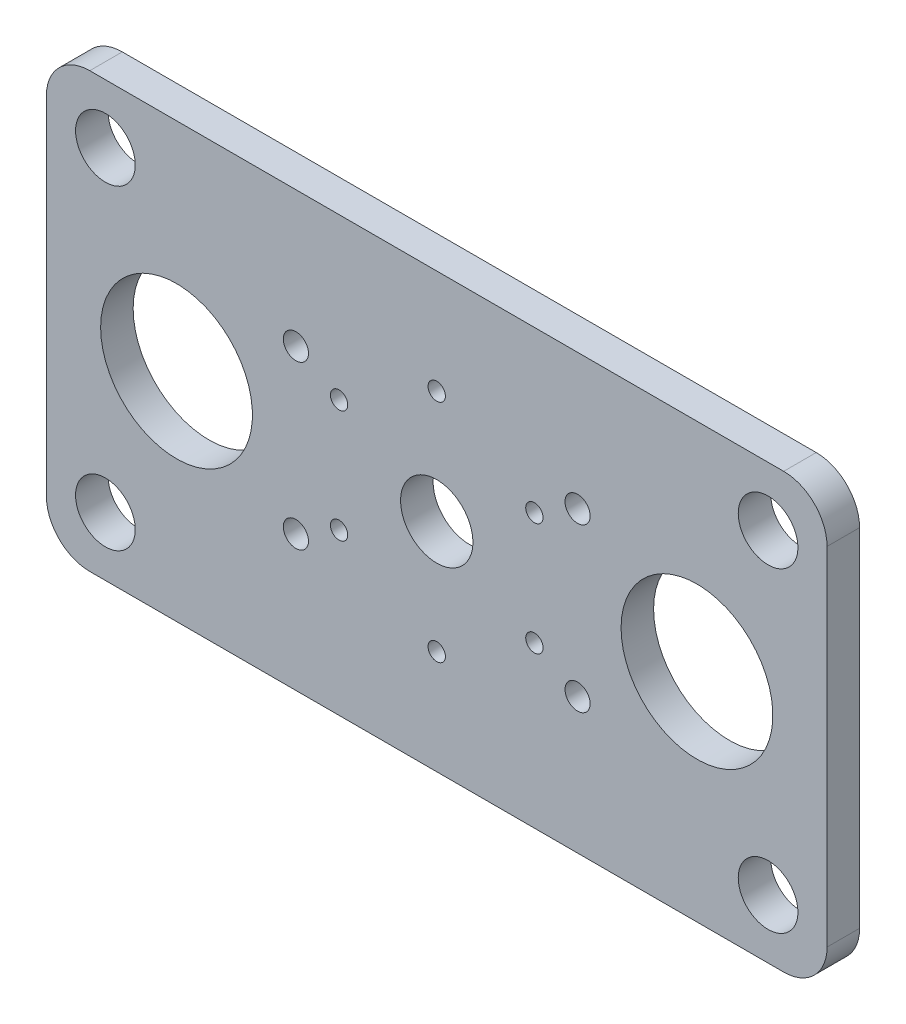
ISO-10303-21;
HEADER;
FILE_DESCRIPTION(('STEP AP214'),'2;1');
FILE_NAME('part.step','',(''),(''),'','','');
FILE_SCHEMA(('AUTOMOTIVE_DESIGN { 1 0 10303 214 1 1 1 1 }'));
ENDSEC;
DATA;
#1=APPLICATION_CONTEXT('core data for automotive mechanical design processes');
#2=APPLICATION_PROTOCOL_DEFINITION('international standard','automotive_design',2000,#1);
#3=PRODUCT_CONTEXT('',#1,'mechanical');
#4=PRODUCT('Part','Part','',(#3));
#5=PRODUCT_RELATED_PRODUCT_CATEGORY('part','',(#4));
#6=PRODUCT_DEFINITION_FORMATION('','',#4);
#7=PRODUCT_DEFINITION_CONTEXT('part definition',#1,'design');
#8=PRODUCT_DEFINITION('design','',#6,#7);
#9=PRODUCT_DEFINITION_SHAPE('','',#8);
#10=(LENGTH_UNIT() NAMED_UNIT(*) SI_UNIT(.MILLI.,.METRE.));
#11=(NAMED_UNIT(*) PLANE_ANGLE_UNIT() SI_UNIT($,.RADIAN.));
#12=(NAMED_UNIT(*) SI_UNIT($,.STERADIAN.) SOLID_ANGLE_UNIT());
#13=UNCERTAINTY_MEASURE_WITH_UNIT(LENGTH_MEASURE(1.E-05),#10,'distance_accuracy_value','');
#14=(GEOMETRIC_REPRESENTATION_CONTEXT(3) GLOBAL_UNCERTAINTY_ASSIGNED_CONTEXT((#13)) GLOBAL_UNIT_ASSIGNED_CONTEXT((#10,
#11,#12)) REPRESENTATION_CONTEXT('',''));
#15=CARTESIAN_POINT('',(0.,0.,0.));
#16=DIRECTION('',(0.,0.,1.));
#17=DIRECTION('',(1.,0.,0.));
#18=AXIS2_PLACEMENT_3D('',#15,#16,#17);
#19=CARTESIAN_POINT('',(0.,0.,4.7625));
#20=DIRECTION('',(0.,0.,1.));
#21=DIRECTION('',(1.,0.,0.));
#22=AXIS2_PLACEMENT_3D('',#19,#20,#21);
#23=PLANE('',#22);
#24=CARTESIAN_POINT('',(-14.298079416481,8.25500000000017,4.7625));
#25=DIRECTION('',(0.,0.,1.));
#26=DIRECTION('',(1.,0.,0.));
#27=AXIS2_PLACEMENT_3D('',#24,#25,#26);
#28=CIRCLE('',#27,1.27);
#29=CARTESIAN_POINT('',(-13.028079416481,8.25500000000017,4.7625));
#30=VERTEX_POINT('',#29);
#31=EDGE_CURVE('E323',#30,#30,#28,.T.);
#32=ORIENTED_EDGE('',*,*,#31,.F.);
#33=EDGE_LOOP('',(#32));
#34=FACE_BOUND('',#33,.T.);
#35=CARTESIAN_POINT('',(-14.2980794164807,-8.25500000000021,4.7625));
#36=DIRECTION('',(0.,0.,1.));
#37=DIRECTION('',(1.,0.,0.));
#38=AXIS2_PLACEMENT_3D('',#35,#36,#37);
#39=CIRCLE('',#38,1.27000000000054);
#40=CARTESIAN_POINT('',(-13.0280794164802,-8.25500000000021,4.7625));
#41=VERTEX_POINT('',#40);
#42=EDGE_CURVE('E317',#41,#41,#39,.T.);
#43=ORIENTED_EDGE('',*,*,#42,.F.);
#44=EDGE_LOOP('',(#43));
#45=FACE_BOUND('',#44,.T.);
#46=CARTESIAN_POINT('',(4.65762352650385E-13,-16.51,4.7625));
#47=DIRECTION('',(0.,0.,1.));
#48=DIRECTION('',(1.,0.,0.));
#49=AXIS2_PLACEMENT_3D('',#46,#47,#48);
#50=CIRCLE('',#49,1.27000000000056);
#51=CARTESIAN_POINT('',(1.27000000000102,-16.51,4.7625));
#52=VERTEX_POINT('',#51);
#53=EDGE_CURVE('E311',#52,#52,#50,.T.);
#54=ORIENTED_EDGE('',*,*,#53,.F.);
#55=EDGE_LOOP('',(#54));
#56=FACE_BOUND('',#55,.T.);
#57=CARTESIAN_POINT('',(14.2980794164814,-8.2549999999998,4.7625));
#58=DIRECTION('',(0.,0.,1.));
#59=DIRECTION('',(1.,0.,0.));
#60=AXIS2_PLACEMENT_3D('',#57,#58,#59);
#61=CIRCLE('',#60,1.27000000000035);
#62=CARTESIAN_POINT('',(15.5680794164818,-8.2549999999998,4.7625));
#63=VERTEX_POINT('',#62);
#64=EDGE_CURVE('E305',#63,#63,#61,.T.);
#65=ORIENTED_EDGE('',*,*,#64,.F.);
#66=EDGE_LOOP('',(#65));
#67=FACE_BOUND('',#66,.T.);
#68=CARTESIAN_POINT('',(14.2980794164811,8.25499999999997,4.7625));
#69=DIRECTION('',(0.,0.,1.));
#70=DIRECTION('',(1.,0.,0.));
#71=AXIS2_PLACEMENT_3D('',#68,#69,#70);
#72=CIRCLE('',#71,1.27);
#73=CARTESIAN_POINT('',(15.5680794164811,8.25499999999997,4.7625));
#74=VERTEX_POINT('',#73);
#75=EDGE_CURVE('E299',#74,#74,#72,.T.);
#76=ORIENTED_EDGE('',*,*,#75,.F.);
#77=EDGE_LOOP('',(#76));
#78=FACE_BOUND('',#77,.T.);
#79=CARTESIAN_POINT('',(0.,16.51,4.7625));
#80=DIRECTION('',(0.,0.,1.));
#81=DIRECTION('',(1.,0.,0.));
#82=AXIS2_PLACEMENT_3D('',#79,#80,#81);
#83=CIRCLE('',#82,1.27);
#84=CARTESIAN_POINT('',(1.27,16.51,4.7625));
#85=VERTEX_POINT('',#84);
#86=EDGE_CURVE('E293',#85,#85,#83,.T.);
#87=ORIENTED_EDGE('',*,*,#86,.F.);
#88=EDGE_LOOP('',(#87));
#89=FACE_BOUND('',#88,.T.);
#90=CARTESIAN_POINT('',(-20.6222299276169,11.90625,4.7625));
#91=DIRECTION('',(0.,0.,-1.));
#92=DIRECTION('',(-1.,0.,0.));
#93=AXIS2_PLACEMENT_3D('',#90,#91,#92);
#94=CIRCLE('',#93,1.8415);
#95=CARTESIAN_POINT('',(-22.4637299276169,11.90625,4.7625));
#96=VERTEX_POINT('',#95);
#97=EDGE_CURVE('E178',#96,#96,#94,.T.);
#98=ORIENTED_EDGE('',*,*,#97,.T.);
#99=EDGE_LOOP('',(#98));
#100=FACE_BOUND('',#99,.T.);
#101=CARTESIAN_POINT('',(-20.6222299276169,-11.90625,4.7625));
#102=DIRECTION('',(0.,0.,-1.));
#103=DIRECTION('',(-1.,0.,0.));
#104=AXIS2_PLACEMENT_3D('',#101,#102,#103);
#105=CIRCLE('',#104,1.8415);
#106=CARTESIAN_POINT('',(-22.4637299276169,-11.90625,4.7625));
#107=VERTEX_POINT('',#106);
#108=EDGE_CURVE('E181',#107,#107,#105,.T.);
#109=ORIENTED_EDGE('',*,*,#108,.T.);
#110=EDGE_LOOP('',(#109));
#111=FACE_BOUND('',#110,.T.);
#112=CARTESIAN_POINT('',(20.6222299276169,-11.90625,4.7625));
#113=DIRECTION('',(0.,0.,-1.));
#114=DIRECTION('',(-1.,0.,0.));
#115=AXIS2_PLACEMENT_3D('',#112,#113,#114);
#116=CIRCLE('',#115,1.84149999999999);
#117=CARTESIAN_POINT('',(18.780729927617,-11.90625,4.7625));
#118=VERTEX_POINT('',#117);
#119=EDGE_CURVE('E184',#118,#118,#116,.T.);
#120=ORIENTED_EDGE('',*,*,#119,.T.);
#121=EDGE_LOOP('',(#120));
#122=FACE_BOUND('',#121,.T.);
#123=CARTESIAN_POINT('',(20.622229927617,11.90625,4.7625));
#124=DIRECTION('',(0.,0.,-1.));
#125=DIRECTION('',(-1.,0.,0.));
#126=AXIS2_PLACEMENT_3D('',#123,#124,#125);
#127=CIRCLE('',#126,1.8415);
#128=CARTESIAN_POINT('',(18.780729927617,11.90625,4.7625));
#129=VERTEX_POINT('',#128);
#130=EDGE_CURVE('E187',#129,#129,#127,.T.);
#131=ORIENTED_EDGE('',*,*,#130,.T.);
#132=EDGE_LOOP('',(#131));
#133=FACE_BOUND('',#132,.T.);
#134=CARTESIAN_POINT('',(-38.1,0.,4.7625));
#135=DIRECTION('',(0.,0.,-1.));
#136=DIRECTION('',(-1.,0.,0.));
#137=AXIS2_PLACEMENT_3D('',#134,#135,#136);
#138=CIRCLE('',#137,11.1125);
#139=CARTESIAN_POINT('',(-49.2125,0.,4.7625));
#140=VERTEX_POINT('',#139);
#141=EDGE_CURVE('E190',#140,#140,#138,.T.);
#142=ORIENTED_EDGE('',*,*,#141,.T.);
#143=EDGE_LOOP('',(#142));
#144=FACE_BOUND('',#143,.T.);
#145=CARTESIAN_POINT('',(38.1,0.,4.7625));
#146=DIRECTION('',(0.,0.,-1.));
#147=DIRECTION('',(-1.,0.,0.));
#148=AXIS2_PLACEMENT_3D('',#145,#146,#147);
#149=CIRCLE('',#148,11.1125);
#150=CARTESIAN_POINT('',(26.9875,0.,4.7625));
#151=VERTEX_POINT('',#150);
#152=EDGE_CURVE('E193',#151,#151,#149,.T.);
#153=ORIENTED_EDGE('',*,*,#152,.T.);
#154=EDGE_LOOP('',(#153));
#155=FACE_BOUND('',#154,.T.);
#156=CARTESIAN_POINT('',(48.514,-23.1140000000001,4.7625));
#157=DIRECTION('',(0.,0.,-1.));
#158=DIRECTION('',(-1.,0.,0.));
#159=AXIS2_PLACEMENT_3D('',#156,#157,#158);
#160=CIRCLE('',#159,4.36880000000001);
#161=CARTESIAN_POINT('',(44.1452,-23.1140000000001,4.7625));
#162=VERTEX_POINT('',#161);
#163=EDGE_CURVE('E196',#162,#162,#160,.T.);
#164=ORIENTED_EDGE('',*,*,#163,.T.);
#165=EDGE_LOOP('',(#164));
#166=FACE_BOUND('',#165,.T.);
#167=CARTESIAN_POINT('',(48.514,23.1140000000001,4.7625));
#168=DIRECTION('',(0.,0.,-1.));
#169=DIRECTION('',(-1.,0.,0.));
#170=AXIS2_PLACEMENT_3D('',#167,#168,#169);
#171=CIRCLE('',#170,4.3688);
#172=CARTESIAN_POINT('',(44.1452,23.1140000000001,4.7625));
#173=VERTEX_POINT('',#172);
#174=EDGE_CURVE('E199',#173,#173,#171,.T.);
#175=ORIENTED_EDGE('',*,*,#174,.T.);
#176=EDGE_LOOP('',(#175));
#177=FACE_BOUND('',#176,.T.);
#178=CARTESIAN_POINT('',(-48.514,-23.114,4.7625));
#179=DIRECTION('',(0.,0.,-1.));
#180=DIRECTION('',(-1.,0.,0.));
#181=AXIS2_PLACEMENT_3D('',#178,#179,#180);
#182=CIRCLE('',#181,4.3688);
#183=CARTESIAN_POINT('',(-52.8828,-23.114,4.7625));
#184=VERTEX_POINT('',#183);
#185=EDGE_CURVE('E202',#184,#184,#182,.T.);
#186=ORIENTED_EDGE('',*,*,#185,.T.);
#187=EDGE_LOOP('',(#186));
#188=FACE_BOUND('',#187,.T.);
#189=CARTESIAN_POINT('',(-48.514,23.114,4.7625));
#190=DIRECTION('',(0.,0.,-1.));
#191=DIRECTION('',(-1.,0.,0.));
#192=AXIS2_PLACEMENT_3D('',#189,#190,#191);
#193=CIRCLE('',#192,4.36880000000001);
#194=CARTESIAN_POINT('',(-52.8828,23.114,4.7625));
#195=VERTEX_POINT('',#194);
#196=EDGE_CURVE('E205',#195,#195,#193,.T.);
#197=ORIENTED_EDGE('',*,*,#196,.T.);
#198=EDGE_LOOP('',(#197));
#199=FACE_BOUND('',#198,.T.);
#200=CARTESIAN_POINT('',(0.,0.,4.7625));
#201=DIRECTION('',(0.,0.,-1.));
#202=DIRECTION('',(-1.,0.,0.));
#203=AXIS2_PLACEMENT_3D('',#200,#201,#202);
#204=CIRCLE('',#203,5.2959);
#205=CARTESIAN_POINT('',(-5.2959,0.,4.7625));
#206=VERTEX_POINT('',#205);
#207=EDGE_CURVE('E208',#206,#206,#204,.T.);
#208=ORIENTED_EDGE('',*,*,#207,.T.);
#209=EDGE_LOOP('',(#208));
#210=FACE_BOUND('',#209,.T.);
#211=DIRECTION('',(0.,1.,0.));
#212=VECTOR('',#211,1.);
#213=CARTESIAN_POINT('',(57.15,25.4,4.7625));
#214=LINE('',#213,#212);
#215=CARTESIAN_POINT('',(57.15,25.4,4.7625));
#216=VERTEX_POINT('',#215);
#217=CARTESIAN_POINT('',(57.15,-25.4,4.7625));
#218=VERTEX_POINT('',#217);
#219=EDGE_CURVE('E132',#216,#218,#214,.F.);
#220=ORIENTED_EDGE('',*,*,#219,.F.);
#221=CARTESIAN_POINT('',(50.8,25.4,4.7625));
#222=DIRECTION('',(0.,0.,1.));
#223=DIRECTION('',(1.,0.,0.));
#224=AXIS2_PLACEMENT_3D('',#221,#222,#223);
#225=CIRCLE('',#224,6.35);
#226=CARTESIAN_POINT('',(50.8,31.75,4.7625));
#227=VERTEX_POINT('',#226);
#228=EDGE_CURVE('E213',#227,#216,#225,.F.);
#229=ORIENTED_EDGE('',*,*,#228,.F.);
#230=DIRECTION('',(1.,0.,0.));
#231=VECTOR('',#230,1.);
#232=CARTESIAN_POINT('',(21.0605674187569,31.75,4.7625));
#233=LINE('',#232,#231);
#234=CARTESIAN_POINT('',(-50.8,31.75,4.7625));
#235=VERTEX_POINT('',#234);
#236=EDGE_CURVE('E128',#235,#227,#233,.T.);
#237=ORIENTED_EDGE('',*,*,#236,.F.);
#238=CARTESIAN_POINT('',(-50.8,25.4,4.7625));
#239=DIRECTION('',(0.,0.,1.));
#240=DIRECTION('',(1.,0.,0.));
#241=AXIS2_PLACEMENT_3D('',#238,#239,#240);
#242=CIRCLE('',#241,6.35);
#243=CARTESIAN_POINT('',(-57.15,25.4,4.7625));
#244=VERTEX_POINT('',#243);
#245=EDGE_CURVE('E114',#244,#235,#242,.F.);
#246=ORIENTED_EDGE('',*,*,#245,.F.);
#247=DIRECTION('',(0.,1.,0.));
#248=VECTOR('',#247,1.);
#249=CARTESIAN_POINT('',(-57.15,-25.4,4.7625));
#250=LINE('',#249,#248);
#251=CARTESIAN_POINT('',(-57.15,-25.4,4.7625));
#252=VERTEX_POINT('',#251);
#253=EDGE_CURVE('E110',#252,#244,#250,.T.);
#254=ORIENTED_EDGE('',*,*,#253,.F.);
#255=CARTESIAN_POINT('',(-50.8,-25.4,4.7625));
#256=DIRECTION('',(0.,0.,1.));
#257=DIRECTION('',(1.,0.,0.));
#258=AXIS2_PLACEMENT_3D('',#255,#256,#257);
#259=CIRCLE('',#258,6.35);
#260=CARTESIAN_POINT('',(-50.8,-31.7500000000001,4.7625));
#261=VERTEX_POINT('',#260);
#262=EDGE_CURVE('E38',#261,#252,#259,.F.);
#263=ORIENTED_EDGE('',*,*,#262,.F.);
#264=DIRECTION('',(1.,0.,0.));
#265=VECTOR('',#264,1.);
#266=CARTESIAN_POINT('',(21.0605674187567,-31.7500000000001,4.7625));
#267=LINE('',#266,#265);
#268=CARTESIAN_POINT('',(50.8,-31.75,4.7625));
#269=VERTEX_POINT('',#268);
#270=EDGE_CURVE('E97',#269,#261,#267,.F.);
#271=ORIENTED_EDGE('',*,*,#270,.F.);
#272=CARTESIAN_POINT('',(50.8,-25.4,4.7625));
#273=DIRECTION('',(0.,0.,1.));
#274=DIRECTION('',(1.,0.,0.));
#275=AXIS2_PLACEMENT_3D('',#272,#273,#274);
#276=CIRCLE('',#275,6.35);
#277=EDGE_CURVE('E214',#218,#269,#276,.F.);
#278=ORIENTED_EDGE('',*,*,#277,.F.);
#279=EDGE_LOOP('',(#220,#229,#237,#246,#254,#263,#271,#278));
#280=FACE_BOUND('',#279,.T.);
#281=ADVANCED_FACE('F34',(#34,#45,#56,#67,#78,#89,#100,#111,#122,#133,#144,#155,#166,#177,#188,
#199,#210,#280),#23,.T.);
#282=CARTESIAN_POINT('',(-57.15,-25.4,0.));
#283=DIRECTION('',(-1.,0.,0.));
#284=DIRECTION('',(0.,0.,1.));
#285=AXIS2_PLACEMENT_3D('',#282,#283,#284);
#286=PLANE('',#285);
#287=DIRECTION('',(0.,1.,0.));
#288=VECTOR('',#287,1.);
#289=CARTESIAN_POINT('',(-57.15,0.,0.));
#290=LINE('',#289,#288);
#291=CARTESIAN_POINT('',(-57.15,25.4,0.));
#292=VERTEX_POINT('',#291);
#293=CARTESIAN_POINT('',(-57.15,-25.4,0.));
#294=VERTEX_POINT('',#293);
#295=EDGE_CURVE('E122',#292,#294,#290,.F.);
#296=ORIENTED_EDGE('',*,*,#295,.T.);
#297=DIRECTION('',(0.,0.,1.));
#298=VECTOR('',#297,1.);
#299=CARTESIAN_POINT('',(-57.15,-25.4,0.));
#300=LINE('',#299,#298);
#301=EDGE_CURVE('E106',#252,#294,#300,.F.);
#302=ORIENTED_EDGE('',*,*,#301,.F.);
#303=ORIENTED_EDGE('',*,*,#253,.T.);
#304=DIRECTION('',(0.,0.,1.));
#305=VECTOR('',#304,1.);
#306=CARTESIAN_POINT('',(-57.15,25.4,0.));
#307=LINE('',#306,#305);
#308=EDGE_CURVE('E211',#292,#244,#307,.T.);
#309=ORIENTED_EDGE('',*,*,#308,.F.);
#310=EDGE_LOOP('',(#296,#302,#303,#309));
#311=FACE_BOUND('',#310,.T.);
#312=ADVANCED_FACE('F121',(#311),#286,.T.);
#313=CARTESIAN_POINT('',(-50.8,-25.4,0.));
#314=DIRECTION('',(0.,0.,1.));
#315=DIRECTION('',(1.,0.,0.));
#316=AXIS2_PLACEMENT_3D('',#313,#314,#315);
#317=CYLINDRICAL_SURFACE('',#316,6.35);
#318=CARTESIAN_POINT('',(-50.8,-25.4,0.));
#319=DIRECTION('',(0.,0.,1.));
#320=DIRECTION('',(1.,0.,0.));
#321=AXIS2_PLACEMENT_3D('',#318,#319,#320);
#322=CIRCLE('',#321,6.35);
#323=CARTESIAN_POINT('',(-50.8,-31.75,0.));
#324=VERTEX_POINT('',#323);
#325=EDGE_CURVE('E176',#294,#324,#322,.T.);
#326=ORIENTED_EDGE('',*,*,#325,.T.);
#327=DIRECTION('',(0.,0.,-1.));
#328=VECTOR('',#327,1.);
#329=CARTESIAN_POINT('',(-50.8,-31.7500000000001,0.));
#330=LINE('',#329,#328);
#331=EDGE_CURVE('E108',#261,#324,#330,.T.);
#332=ORIENTED_EDGE('',*,*,#331,.F.);
#333=ORIENTED_EDGE('',*,*,#262,.T.);
#334=ORIENTED_EDGE('',*,*,#301,.T.);
#335=EDGE_LOOP('',(#326,#332,#333,#334));
#336=FACE_BOUND('',#335,.T.);
#337=ADVANCED_FACE('F104',(#336),#317,.T.);
#338=CARTESIAN_POINT('',(21.0605674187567,-31.7500000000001,0.));
#339=DIRECTION('',(0.,-1.,0.));
#340=DIRECTION('',(0.,0.,-1.));
#341=AXIS2_PLACEMENT_3D('',#338,#339,#340);
#342=PLANE('',#341);
#343=DIRECTION('',(1.,0.,0.));
#344=VECTOR('',#343,1.);
#345=CARTESIAN_POINT('',(0.,-31.75,0.));
#346=LINE('',#345,#344);
#347=CARTESIAN_POINT('',(50.8,-31.75,0.));
#348=VERTEX_POINT('',#347);
#349=EDGE_CURVE('E175',#324,#348,#346,.T.);
#350=ORIENTED_EDGE('',*,*,#349,.T.);
#351=DIRECTION('',(0.,0.,1.));
#352=VECTOR('',#351,1.);
#353=CARTESIAN_POINT('',(50.8,-31.75,0.));
#354=LINE('',#353,#352);
#355=EDGE_CURVE('E134',#269,#348,#354,.F.);
#356=ORIENTED_EDGE('',*,*,#355,.F.);
#357=ORIENTED_EDGE('',*,*,#270,.T.);
#358=ORIENTED_EDGE('',*,*,#331,.T.);
#359=EDGE_LOOP('',(#350,#356,#357,#358));
#360=FACE_BOUND('',#359,.T.);
#361=ADVANCED_FACE('F220',(#360),#342,.T.);
#362=CARTESIAN_POINT('',(50.8,-25.4,0.));
#363=DIRECTION('',(0.,0.,1.));
#364=DIRECTION('',(1.,0.,0.));
#365=AXIS2_PLACEMENT_3D('',#362,#363,#364);
#366=CYLINDRICAL_SURFACE('',#365,6.35);
#367=CARTESIAN_POINT('',(50.8,-25.4,0.));
#368=DIRECTION('',(0.,0.,1.));
#369=DIRECTION('',(1.,0.,0.));
#370=AXIS2_PLACEMENT_3D('',#367,#368,#369);
#371=CIRCLE('',#370,6.35);
#372=CARTESIAN_POINT('',(57.15,-25.4,0.));
#373=VERTEX_POINT('',#372);
#374=EDGE_CURVE('E172',#348,#373,#371,.T.);
#375=ORIENTED_EDGE('',*,*,#374,.T.);
#376=DIRECTION('',(0.,0.,-1.));
#377=VECTOR('',#376,1.);
#378=CARTESIAN_POINT('',(57.15,-25.4,0.));
#379=LINE('',#378,#377);
#380=EDGE_CURVE('E133',#218,#373,#379,.T.);
#381=ORIENTED_EDGE('',*,*,#380,.F.);
#382=ORIENTED_EDGE('',*,*,#277,.T.);
#383=ORIENTED_EDGE('',*,*,#355,.T.);
#384=EDGE_LOOP('',(#375,#381,#382,#383));
#385=FACE_BOUND('',#384,.T.);
#386=ADVANCED_FACE('F240',(#385),#366,.T.);
#387=CARTESIAN_POINT('',(57.15,25.4,0.));
#388=DIRECTION('',(1.,0.,0.));
#389=DIRECTION('',(0.,0.,-1.));
#390=AXIS2_PLACEMENT_3D('',#387,#388,#389);
#391=PLANE('',#390);
#392=DIRECTION('',(0.,1.,0.));
#393=VECTOR('',#392,1.);
#394=CARTESIAN_POINT('',(57.15,0.,0.));
#395=LINE('',#394,#393);
#396=CARTESIAN_POINT('',(57.15,25.4,0.));
#397=VERTEX_POINT('',#396);
#398=EDGE_CURVE('E171',#373,#397,#395,.T.);
#399=ORIENTED_EDGE('',*,*,#398,.T.);
#400=DIRECTION('',(0.,0.,1.));
#401=VECTOR('',#400,1.);
#402=CARTESIAN_POINT('',(57.15,25.4,0.));
#403=LINE('',#402,#401);
#404=EDGE_CURVE('E131',#216,#397,#403,.F.);
#405=ORIENTED_EDGE('',*,*,#404,.F.);
#406=ORIENTED_EDGE('',*,*,#219,.T.);
#407=ORIENTED_EDGE('',*,*,#380,.T.);
#408=EDGE_LOOP('',(#399,#405,#406,#407));
#409=FACE_BOUND('',#408,.T.);
#410=ADVANCED_FACE('F237',(#409),#391,.T.);
#411=CARTESIAN_POINT('',(50.8,25.4,0.));
#412=DIRECTION('',(0.,0.,1.));
#413=DIRECTION('',(1.,0.,0.));
#414=AXIS2_PLACEMENT_3D('',#411,#412,#413);
#415=CYLINDRICAL_SURFACE('',#414,6.35);
#416=CARTESIAN_POINT('',(50.8,25.4,0.));
#417=DIRECTION('',(0.,0.,1.));
#418=DIRECTION('',(1.,0.,0.));
#419=AXIS2_PLACEMENT_3D('',#416,#417,#418);
#420=CIRCLE('',#419,6.35);
#421=CARTESIAN_POINT('',(50.8,31.75,0.));
#422=VERTEX_POINT('',#421);
#423=EDGE_CURVE('E168',#397,#422,#420,.T.);
#424=ORIENTED_EDGE('',*,*,#423,.T.);
#425=DIRECTION('',(0.,0.,1.));
#426=VECTOR('',#425,1.);
#427=CARTESIAN_POINT('',(50.8,31.75,0.));
#428=LINE('',#427,#426);
#429=EDGE_CURVE('E130',#227,#422,#428,.F.);
#430=ORIENTED_EDGE('',*,*,#429,.F.);
#431=ORIENTED_EDGE('',*,*,#228,.T.);
#432=ORIENTED_EDGE('',*,*,#404,.T.);
#433=EDGE_LOOP('',(#424,#430,#431,#432));
#434=FACE_BOUND('',#433,.T.);
#435=ADVANCED_FACE('F247',(#434),#415,.T.);
#436=CARTESIAN_POINT('',(21.0605674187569,31.75,0.));
#437=DIRECTION('',(0.,1.,0.));
#438=DIRECTION('',(0.,0.,1.));
#439=AXIS2_PLACEMENT_3D('',#436,#437,#438);
#440=PLANE('',#439);
#441=DIRECTION('',(1.,0.,0.));
#442=VECTOR('',#441,1.);
#443=CARTESIAN_POINT('',(0.,31.75,0.));
#444=LINE('',#443,#442);
#445=CARTESIAN_POINT('',(-50.8,31.75,0.));
#446=VERTEX_POINT('',#445);
#447=EDGE_CURVE('E167',#422,#446,#444,.F.);
#448=ORIENTED_EDGE('',*,*,#447,.T.);
#449=DIRECTION('',(0.,0.,1.));
#450=VECTOR('',#449,1.);
#451=CARTESIAN_POINT('',(-50.8,31.75,0.));
#452=LINE('',#451,#450);
#453=EDGE_CURVE('E53',#235,#446,#452,.F.);
#454=ORIENTED_EDGE('',*,*,#453,.F.);
#455=ORIENTED_EDGE('',*,*,#236,.T.);
#456=ORIENTED_EDGE('',*,*,#429,.T.);
#457=EDGE_LOOP('',(#448,#454,#455,#456));
#458=FACE_BOUND('',#457,.T.);
#459=ADVANCED_FACE('F281',(#458),#440,.T.);
#460=CARTESIAN_POINT('',(-50.8,25.4,0.));
#461=DIRECTION('',(0.,0.,1.));
#462=DIRECTION('',(1.,0.,0.));
#463=AXIS2_PLACEMENT_3D('',#460,#461,#462);
#464=CYLINDRICAL_SURFACE('',#463,6.35);
#465=CARTESIAN_POINT('',(-50.8,25.4,0.));
#466=DIRECTION('',(0.,0.,1.));
#467=DIRECTION('',(1.,0.,0.));
#468=AXIS2_PLACEMENT_3D('',#465,#466,#467);
#469=CIRCLE('',#468,6.35);
#470=EDGE_CURVE('E165',#446,#292,#469,.T.);
#471=ORIENTED_EDGE('',*,*,#470,.T.);
#472=ORIENTED_EDGE('',*,*,#308,.T.);
#473=ORIENTED_EDGE('',*,*,#245,.T.);
#474=ORIENTED_EDGE('',*,*,#453,.T.);
#475=EDGE_LOOP('',(#471,#472,#473,#474));
#476=FACE_BOUND('',#475,.T.);
#477=ADVANCED_FACE('F277',(#476),#464,.T.);
#478=CARTESIAN_POINT('',(0.,0.,4.7625));
#479=DIRECTION('',(0.,0.,-1.));
#480=DIRECTION('',(-1.,0.,0.));
#481=AXIS2_PLACEMENT_3D('',#478,#479,#480);
#482=CYLINDRICAL_SURFACE('',#481,5.2959);
#483=ORIENTED_EDGE('',*,*,#207,.F.);
#484=EDGE_LOOP('',(#483));
#485=FACE_BOUND('',#484,.T.);
#486=CARTESIAN_POINT('',(0.,0.,0.));
#487=DIRECTION('',(0.,0.,-1.));
#488=DIRECTION('',(-1.,0.,0.));
#489=AXIS2_PLACEMENT_3D('',#486,#487,#488);
#490=CIRCLE('',#489,5.2959);
#491=CARTESIAN_POINT('',(-5.2959,0.,0.));
#492=VERTEX_POINT('',#491);
#493=EDGE_CURVE('E162',#492,#492,#490,.T.);
#494=ORIENTED_EDGE('',*,*,#493,.T.);
#495=EDGE_LOOP('',(#494));
#496=FACE_BOUND('',#495,.T.);
#497=ADVANCED_FACE('F280',(#485,#496),#482,.F.);
#498=CARTESIAN_POINT('',(-48.514,23.114,4.7625));
#499=DIRECTION('',(0.,0.,-1.));
#500=DIRECTION('',(-1.,0.,0.));
#501=AXIS2_PLACEMENT_3D('',#498,#499,#500);
#502=CYLINDRICAL_SURFACE('',#501,4.36880000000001);
#503=ORIENTED_EDGE('',*,*,#196,.F.);
#504=EDGE_LOOP('',(#503));
#505=FACE_BOUND('',#504,.T.);
#506=CARTESIAN_POINT('',(-48.514,23.114,0.));
#507=DIRECTION('',(0.,0.,-1.));
#508=DIRECTION('',(-1.,0.,0.));
#509=AXIS2_PLACEMENT_3D('',#506,#507,#508);
#510=CIRCLE('',#509,4.36880000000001);
#511=CARTESIAN_POINT('',(-52.8828,23.114,0.));
#512=VERTEX_POINT('',#511);
#513=EDGE_CURVE('E159',#512,#512,#510,.T.);
#514=ORIENTED_EDGE('',*,*,#513,.T.);
#515=EDGE_LOOP('',(#514));
#516=FACE_BOUND('',#515,.T.);
#517=ADVANCED_FACE('F372',(#505,#516),#502,.F.);
#518=CARTESIAN_POINT('',(-48.514,-23.114,4.7625));
#519=DIRECTION('',(0.,0.,-1.));
#520=DIRECTION('',(-1.,0.,0.));
#521=AXIS2_PLACEMENT_3D('',#518,#519,#520);
#522=CYLINDRICAL_SURFACE('',#521,4.3688);
#523=ORIENTED_EDGE('',*,*,#185,.F.);
#524=EDGE_LOOP('',(#523));
#525=FACE_BOUND('',#524,.T.);
#526=CARTESIAN_POINT('',(-48.514,-23.114,0.));
#527=DIRECTION('',(0.,0.,-1.));
#528=DIRECTION('',(-1.,0.,0.));
#529=AXIS2_PLACEMENT_3D('',#526,#527,#528);
#530=CIRCLE('',#529,4.3688);
#531=CARTESIAN_POINT('',(-52.8828,-23.114,0.));
#532=VERTEX_POINT('',#531);
#533=EDGE_CURVE('E156',#532,#532,#530,.T.);
#534=ORIENTED_EDGE('',*,*,#533,.T.);
#535=EDGE_LOOP('',(#534));
#536=FACE_BOUND('',#535,.T.);
#537=ADVANCED_FACE('F379',(#525,#536),#522,.F.);
#538=CARTESIAN_POINT('',(48.514,23.1140000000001,4.7625));
#539=DIRECTION('',(0.,0.,-1.));
#540=DIRECTION('',(-1.,0.,0.));
#541=AXIS2_PLACEMENT_3D('',#538,#539,#540);
#542=CYLINDRICAL_SURFACE('',#541,4.3688);
#543=ORIENTED_EDGE('',*,*,#174,.F.);
#544=EDGE_LOOP('',(#543));
#545=FACE_BOUND('',#544,.T.);
#546=CARTESIAN_POINT('',(48.514,23.1140000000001,0.));
#547=DIRECTION('',(0.,0.,-1.));
#548=DIRECTION('',(-1.,0.,0.));
#549=AXIS2_PLACEMENT_3D('',#546,#547,#548);
#550=CIRCLE('',#549,4.3688);
#551=CARTESIAN_POINT('',(44.1452,23.1140000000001,0.));
#552=VERTEX_POINT('',#551);
#553=EDGE_CURVE('E153',#552,#552,#550,.T.);
#554=ORIENTED_EDGE('',*,*,#553,.T.);
#555=EDGE_LOOP('',(#554));
#556=FACE_BOUND('',#555,.T.);
#557=ADVANCED_FACE('F386',(#545,#556),#542,.F.);
#558=CARTESIAN_POINT('',(48.514,-23.1140000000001,4.7625));
#559=DIRECTION('',(0.,0.,-1.));
#560=DIRECTION('',(-1.,0.,0.));
#561=AXIS2_PLACEMENT_3D('',#558,#559,#560);
#562=CYLINDRICAL_SURFACE('',#561,4.36880000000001);
#563=ORIENTED_EDGE('',*,*,#163,.F.);
#564=EDGE_LOOP('',(#563));
#565=FACE_BOUND('',#564,.T.);
#566=CARTESIAN_POINT('',(48.514,-23.1140000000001,0.));
#567=DIRECTION('',(0.,0.,-1.));
#568=DIRECTION('',(-1.,0.,0.));
#569=AXIS2_PLACEMENT_3D('',#566,#567,#568);
#570=CIRCLE('',#569,4.36880000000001);
#571=CARTESIAN_POINT('',(44.1452,-23.1140000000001,0.));
#572=VERTEX_POINT('',#571);
#573=EDGE_CURVE('E150',#572,#572,#570,.T.);
#574=ORIENTED_EDGE('',*,*,#573,.T.);
#575=EDGE_LOOP('',(#574));
#576=FACE_BOUND('',#575,.T.);
#577=ADVANCED_FACE('F275',(#565,#576),#562,.F.);
#578=CARTESIAN_POINT('',(38.1,0.,4.7625));
#579=DIRECTION('',(0.,0.,-1.));
#580=DIRECTION('',(-1.,0.,0.));
#581=AXIS2_PLACEMENT_3D('',#578,#579,#580);
#582=CYLINDRICAL_SURFACE('',#581,11.1125);
#583=ORIENTED_EDGE('',*,*,#152,.F.);
#584=EDGE_LOOP('',(#583));
#585=FACE_BOUND('',#584,.T.);
#586=CARTESIAN_POINT('',(38.1,0.,0.));
#587=DIRECTION('',(0.,0.,-1.));
#588=DIRECTION('',(-1.,0.,0.));
#589=AXIS2_PLACEMENT_3D('',#586,#587,#588);
#590=CIRCLE('',#589,11.1125);
#591=CARTESIAN_POINT('',(26.9875,0.,0.));
#592=VERTEX_POINT('',#591);
#593=EDGE_CURVE('E147',#592,#592,#590,.T.);
#594=ORIENTED_EDGE('',*,*,#593,.T.);
#595=EDGE_LOOP('',(#594));
#596=FACE_BOUND('',#595,.T.);
#597=ADVANCED_FACE('F271',(#585,#596),#582,.F.);
#598=CARTESIAN_POINT('',(-38.1,0.,4.7625));
#599=DIRECTION('',(0.,0.,-1.));
#600=DIRECTION('',(-1.,0.,0.));
#601=AXIS2_PLACEMENT_3D('',#598,#599,#600);
#602=CYLINDRICAL_SURFACE('',#601,11.1125);
#603=ORIENTED_EDGE('',*,*,#141,.F.);
#604=EDGE_LOOP('',(#603));
#605=FACE_BOUND('',#604,.T.);
#606=CARTESIAN_POINT('',(-38.1,0.,0.));
#607=DIRECTION('',(0.,0.,-1.));
#608=DIRECTION('',(-1.,0.,0.));
#609=AXIS2_PLACEMENT_3D('',#606,#607,#608);
#610=CIRCLE('',#609,11.1125);
#611=CARTESIAN_POINT('',(-49.2125,0.,0.));
#612=VERTEX_POINT('',#611);
#613=EDGE_CURVE('E144',#612,#612,#610,.T.);
#614=ORIENTED_EDGE('',*,*,#613,.T.);
#615=EDGE_LOOP('',(#614));
#616=FACE_BOUND('',#615,.T.);
#617=ADVANCED_FACE('F267',(#605,#616),#602,.F.);
#618=CARTESIAN_POINT('',(20.622229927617,11.90625,4.7625));
#619=DIRECTION('',(0.,0.,-1.));
#620=DIRECTION('',(-1.,0.,0.));
#621=AXIS2_PLACEMENT_3D('',#618,#619,#620);
#622=CYLINDRICAL_SURFACE('',#621,1.8415);
#623=ORIENTED_EDGE('',*,*,#130,.F.);
#624=EDGE_LOOP('',(#623));
#625=FACE_BOUND('',#624,.T.);
#626=CARTESIAN_POINT('',(20.622229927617,11.90625,0.));
#627=DIRECTION('',(0.,0.,-1.));
#628=DIRECTION('',(-1.,0.,0.));
#629=AXIS2_PLACEMENT_3D('',#626,#627,#628);
#630=CIRCLE('',#629,1.8415);
#631=CARTESIAN_POINT('',(18.780729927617,11.90625,0.));
#632=VERTEX_POINT('',#631);
#633=EDGE_CURVE('E141',#632,#632,#630,.T.);
#634=ORIENTED_EDGE('',*,*,#633,.T.);
#635=EDGE_LOOP('',(#634));
#636=FACE_BOUND('',#635,.T.);
#637=ADVANCED_FACE('F270',(#625,#636),#622,.F.);
#638=CARTESIAN_POINT('',(20.6222299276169,-11.90625,4.7625));
#639=DIRECTION('',(0.,0.,-1.));
#640=DIRECTION('',(-1.,0.,0.));
#641=AXIS2_PLACEMENT_3D('',#638,#639,#640);
#642=CYLINDRICAL_SURFACE('',#641,1.84149999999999);
#643=ORIENTED_EDGE('',*,*,#119,.F.);
#644=EDGE_LOOP('',(#643));
#645=FACE_BOUND('',#644,.T.);
#646=CARTESIAN_POINT('',(20.6222299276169,-11.90625,0.));
#647=DIRECTION('',(0.,0.,-1.));
#648=DIRECTION('',(-1.,0.,0.));
#649=AXIS2_PLACEMENT_3D('',#646,#647,#648);
#650=CIRCLE('',#649,1.84149999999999);
#651=CARTESIAN_POINT('',(18.780729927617,-11.90625,0.));
#652=VERTEX_POINT('',#651);
#653=EDGE_CURVE('E138',#652,#652,#650,.T.);
#654=ORIENTED_EDGE('',*,*,#653,.T.);
#655=EDGE_LOOP('',(#654));
#656=FACE_BOUND('',#655,.T.);
#657=ADVANCED_FACE('F396',(#645,#656),#642,.F.);
#658=CARTESIAN_POINT('',(-20.6222299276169,-11.90625,4.7625));
#659=DIRECTION('',(0.,0.,-1.));
#660=DIRECTION('',(-1.,0.,0.));
#661=AXIS2_PLACEMENT_3D('',#658,#659,#660);
#662=CYLINDRICAL_SURFACE('',#661,1.8415);
#663=ORIENTED_EDGE('',*,*,#108,.F.);
#664=EDGE_LOOP('',(#663));
#665=FACE_BOUND('',#664,.T.);
#666=CARTESIAN_POINT('',(-20.6222299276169,-11.90625,0.));
#667=DIRECTION('',(0.,0.,-1.));
#668=DIRECTION('',(-1.,0.,0.));
#669=AXIS2_PLACEMENT_3D('',#666,#667,#668);
#670=CIRCLE('',#669,1.8415);
#671=CARTESIAN_POINT('',(-22.4637299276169,-11.90625,0.));
#672=VERTEX_POINT('',#671);
#673=EDGE_CURVE('E44',#672,#672,#670,.T.);
#674=ORIENTED_EDGE('',*,*,#673,.T.);
#675=EDGE_LOOP('',(#674));
#676=FACE_BOUND('',#675,.T.);
#677=ADVANCED_FACE('F261',(#665,#676),#662,.F.);
#678=CARTESIAN_POINT('',(-20.6222299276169,11.90625,4.7625));
#679=DIRECTION('',(0.,0.,-1.));
#680=DIRECTION('',(-1.,0.,0.));
#681=AXIS2_PLACEMENT_3D('',#678,#679,#680);
#682=CYLINDRICAL_SURFACE('',#681,1.8415);
#683=ORIENTED_EDGE('',*,*,#97,.F.);
#684=EDGE_LOOP('',(#683));
#685=FACE_BOUND('',#684,.T.);
#686=CARTESIAN_POINT('',(-20.6222299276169,11.90625,0.));
#687=DIRECTION('',(0.,0.,-1.));
#688=DIRECTION('',(-1.,0.,0.));
#689=AXIS2_PLACEMENT_3D('',#686,#687,#688);
#690=CIRCLE('',#689,1.8415);
#691=CARTESIAN_POINT('',(-22.4637299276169,11.90625,0.));
#692=VERTEX_POINT('',#691);
#693=EDGE_CURVE('E11',#692,#692,#690,.T.);
#694=ORIENTED_EDGE('',*,*,#693,.T.);
#695=EDGE_LOOP('',(#694));
#696=FACE_BOUND('',#695,.T.);
#697=ADVANCED_FACE('F36',(#685,#696),#682,.F.);
#698=CARTESIAN_POINT('',(0.,0.,0.));
#699=DIRECTION('',(0.,0.,1.));
#700=DIRECTION('',(1.,0.,0.));
#701=AXIS2_PLACEMENT_3D('',#698,#699,#700);
#702=PLANE('',#701);
#703=CARTESIAN_POINT('',(-14.298079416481,8.25500000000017,0.));
#704=DIRECTION('',(0.,0.,1.));
#705=DIRECTION('',(1.,0.,0.));
#706=AXIS2_PLACEMENT_3D('',#703,#704,#705);
#707=CIRCLE('',#706,1.27);
#708=CARTESIAN_POINT('',(-13.028079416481,8.25500000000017,0.));
#709=VERTEX_POINT('',#708);
#710=EDGE_CURVE('E320',#709,#709,#707,.T.);
#711=ORIENTED_EDGE('',*,*,#710,.T.);
#712=EDGE_LOOP('',(#711));
#713=FACE_BOUND('',#712,.T.);
#714=CARTESIAN_POINT('',(-14.2980794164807,-8.25500000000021,0.));
#715=DIRECTION('',(0.,0.,1.));
#716=DIRECTION('',(1.,0.,0.));
#717=AXIS2_PLACEMENT_3D('',#714,#715,#716);
#718=CIRCLE('',#717,1.27000000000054);
#719=CARTESIAN_POINT('',(-13.0280794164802,-8.25500000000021,0.));
#720=VERTEX_POINT('',#719);
#721=EDGE_CURVE('E314',#720,#720,#718,.T.);
#722=ORIENTED_EDGE('',*,*,#721,.T.);
#723=EDGE_LOOP('',(#722));
#724=FACE_BOUND('',#723,.T.);
#725=CARTESIAN_POINT('',(4.65762352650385E-13,-16.51,0.));
#726=DIRECTION('',(0.,0.,1.));
#727=DIRECTION('',(1.,0.,0.));
#728=AXIS2_PLACEMENT_3D('',#725,#726,#727);
#729=CIRCLE('',#728,1.27000000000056);
#730=CARTESIAN_POINT('',(1.27000000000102,-16.51,0.));
#731=VERTEX_POINT('',#730);
#732=EDGE_CURVE('E308',#731,#731,#729,.T.);
#733=ORIENTED_EDGE('',*,*,#732,.T.);
#734=EDGE_LOOP('',(#733));
#735=FACE_BOUND('',#734,.T.);
#736=CARTESIAN_POINT('',(14.2980794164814,-8.2549999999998,0.));
#737=DIRECTION('',(0.,0.,1.));
#738=DIRECTION('',(1.,0.,0.));
#739=AXIS2_PLACEMENT_3D('',#736,#737,#738);
#740=CIRCLE('',#739,1.27000000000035);
#741=CARTESIAN_POINT('',(15.5680794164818,-8.2549999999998,0.));
#742=VERTEX_POINT('',#741);
#743=EDGE_CURVE('E302',#742,#742,#740,.T.);
#744=ORIENTED_EDGE('',*,*,#743,.T.);
#745=EDGE_LOOP('',(#744));
#746=FACE_BOUND('',#745,.T.);
#747=CARTESIAN_POINT('',(14.2980794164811,8.25499999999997,0.));
#748=DIRECTION('',(0.,0.,1.));
#749=DIRECTION('',(1.,0.,0.));
#750=AXIS2_PLACEMENT_3D('',#747,#748,#749);
#751=CIRCLE('',#750,1.27);
#752=CARTESIAN_POINT('',(15.5680794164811,8.25499999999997,0.));
#753=VERTEX_POINT('',#752);
#754=EDGE_CURVE('E296',#753,#753,#751,.T.);
#755=ORIENTED_EDGE('',*,*,#754,.T.);
#756=EDGE_LOOP('',(#755));
#757=FACE_BOUND('',#756,.T.);
#758=CARTESIAN_POINT('',(0.,16.51,0.));
#759=DIRECTION('',(0.,0.,1.));
#760=DIRECTION('',(1.,0.,0.));
#761=AXIS2_PLACEMENT_3D('',#758,#759,#760);
#762=CIRCLE('',#761,1.27);
#763=CARTESIAN_POINT('',(1.27,16.51,0.));
#764=VERTEX_POINT('',#763);
#765=EDGE_CURVE('E118',#764,#764,#762,.T.);
#766=ORIENTED_EDGE('',*,*,#765,.T.);
#767=EDGE_LOOP('',(#766));
#768=FACE_BOUND('',#767,.T.);
#769=ORIENTED_EDGE('',*,*,#693,.F.);
#770=EDGE_LOOP('',(#769));
#771=FACE_BOUND('',#770,.T.);
#772=ORIENTED_EDGE('',*,*,#673,.F.);
#773=EDGE_LOOP('',(#772));
#774=FACE_BOUND('',#773,.T.);
#775=ORIENTED_EDGE('',*,*,#653,.F.);
#776=EDGE_LOOP('',(#775));
#777=FACE_BOUND('',#776,.T.);
#778=ORIENTED_EDGE('',*,*,#633,.F.);
#779=EDGE_LOOP('',(#778));
#780=FACE_BOUND('',#779,.T.);
#781=ORIENTED_EDGE('',*,*,#613,.F.);
#782=EDGE_LOOP('',(#781));
#783=FACE_BOUND('',#782,.T.);
#784=ORIENTED_EDGE('',*,*,#593,.F.);
#785=EDGE_LOOP('',(#784));
#786=FACE_BOUND('',#785,.T.);
#787=ORIENTED_EDGE('',*,*,#573,.F.);
#788=EDGE_LOOP('',(#787));
#789=FACE_BOUND('',#788,.T.);
#790=ORIENTED_EDGE('',*,*,#553,.F.);
#791=EDGE_LOOP('',(#790));
#792=FACE_BOUND('',#791,.T.);
#793=ORIENTED_EDGE('',*,*,#533,.F.);
#794=EDGE_LOOP('',(#793));
#795=FACE_BOUND('',#794,.T.);
#796=ORIENTED_EDGE('',*,*,#513,.F.);
#797=EDGE_LOOP('',(#796));
#798=FACE_BOUND('',#797,.T.);
#799=ORIENTED_EDGE('',*,*,#493,.F.);
#800=EDGE_LOOP('',(#799));
#801=FACE_BOUND('',#800,.T.);
#802=ORIENTED_EDGE('',*,*,#447,.F.);
#803=ORIENTED_EDGE('',*,*,#423,.F.);
#804=ORIENTED_EDGE('',*,*,#398,.F.);
#805=ORIENTED_EDGE('',*,*,#374,.F.);
#806=ORIENTED_EDGE('',*,*,#349,.F.);
#807=ORIENTED_EDGE('',*,*,#325,.F.);
#808=ORIENTED_EDGE('',*,*,#295,.F.);
#809=ORIENTED_EDGE('',*,*,#470,.F.);
#810=EDGE_LOOP('',(#802,#803,#804,#805,#806,#807,#808,#809));
#811=FACE_BOUND('',#810,.T.);
#812=ADVANCED_FACE('F224',(#713,#724,#735,#746,#757,#768,#771,#774,#777,#780,#783,#786,#789,
#792,#795,#798,#801,#811),#702,.F.);
#813=CARTESIAN_POINT('',(0.,16.51,0.));
#814=DIRECTION('',(0.,0.,1.));
#815=DIRECTION('',(1.,0.,0.));
#816=AXIS2_PLACEMENT_3D('',#813,#814,#815);
#817=CYLINDRICAL_SURFACE('',#816,1.27);
#818=CARTESIAN_POINT('',(1.27,16.51,0.));
#819=CARTESIAN_POINT('',(1.27,16.51,0.049609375));
#820=CARTESIAN_POINT('',(1.27,16.51,0.09921875));
#821=CARTESIAN_POINT('',(1.27,16.51,0.1984375));
#822=CARTESIAN_POINT('',(1.27,16.51,0.248046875));
#823=CARTESIAN_POINT('',(1.27,16.51,0.347265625));
#824=CARTESIAN_POINT('',(1.27,16.51,0.396875));
#825=CARTESIAN_POINT('',(1.27,16.51,0.49609375));
#826=CARTESIAN_POINT('',(1.27,16.51,0.545703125));
#827=CARTESIAN_POINT('',(1.27,16.51,0.644921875));
#828=CARTESIAN_POINT('',(1.27,16.51,0.69453125));
#829=CARTESIAN_POINT('',(1.27,16.51,0.79375));
#830=CARTESIAN_POINT('',(1.27,16.51,0.843359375));
#831=CARTESIAN_POINT('',(1.27,16.51,0.942578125));
#832=CARTESIAN_POINT('',(1.27,16.51,0.9921875));
#833=CARTESIAN_POINT('',(1.27,16.51,1.09140625));
#834=CARTESIAN_POINT('',(1.27,16.51,1.141015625));
#835=CARTESIAN_POINT('',(1.27,16.51,1.240234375));
#836=CARTESIAN_POINT('',(1.27,16.51,1.28984375));
#837=CARTESIAN_POINT('',(1.27,16.51,1.3890625));
#838=CARTESIAN_POINT('',(1.27,16.51,1.438671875));
#839=CARTESIAN_POINT('',(1.27,16.51,1.537890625));
#840=CARTESIAN_POINT('',(1.27,16.51,1.5875));
#841=CARTESIAN_POINT('',(1.27,16.51,1.68671875));
#842=CARTESIAN_POINT('',(1.27,16.51,1.736328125));
#843=CARTESIAN_POINT('',(1.27,16.51,1.835546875));
#844=CARTESIAN_POINT('',(1.27,16.51,1.88515625));
#845=CARTESIAN_POINT('',(1.27,16.51,1.984375));
#846=CARTESIAN_POINT('',(1.27,16.51,2.033984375));
#847=CARTESIAN_POINT('',(1.27,16.51,2.133203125));
#848=CARTESIAN_POINT('',(1.27,16.51,2.1828125));
#849=CARTESIAN_POINT('',(1.27,16.51,2.28203125));
#850=CARTESIAN_POINT('',(1.27,16.51,2.331640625));
#851=CARTESIAN_POINT('',(1.27,16.51,2.430859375));
#852=CARTESIAN_POINT('',(1.27,16.51,2.48046875));
#853=CARTESIAN_POINT('',(1.27,16.51,2.5796875));
#854=CARTESIAN_POINT('',(1.27,16.51,2.629296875));
#855=CARTESIAN_POINT('',(1.27,16.51,2.728515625));
#856=CARTESIAN_POINT('',(1.27,16.51,2.778125));
#857=CARTESIAN_POINT('',(1.27,16.51,2.87734375));
#858=CARTESIAN_POINT('',(1.27,16.51,2.926953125));
#859=CARTESIAN_POINT('',(1.27,16.51,3.026171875));
#860=CARTESIAN_POINT('',(1.27,16.51,3.07578125));
#861=CARTESIAN_POINT('',(1.27,16.51,3.175));
#862=CARTESIAN_POINT('',(1.27,16.51,3.224609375));
#863=CARTESIAN_POINT('',(1.27,16.51,3.323828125));
#864=CARTESIAN_POINT('',(1.27,16.51,3.3734375));
#865=CARTESIAN_POINT('',(1.27,16.51,3.47265625));
#866=CARTESIAN_POINT('',(1.27,16.51,3.522265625));
#867=CARTESIAN_POINT('',(1.27,16.51,3.621484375));
#868=CARTESIAN_POINT('',(1.27,16.51,3.67109375));
#869=CARTESIAN_POINT('',(1.27,16.51,3.7703125));
#870=CARTESIAN_POINT('',(1.27,16.51,3.819921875));
#871=CARTESIAN_POINT('',(1.27,16.51,3.919140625));
#872=CARTESIAN_POINT('',(1.27,16.51,3.96875));
#873=CARTESIAN_POINT('',(1.27,16.51,4.06796875));
#874=CARTESIAN_POINT('',(1.27,16.51,4.117578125));
#875=CARTESIAN_POINT('',(1.27,16.51,4.216796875));
#876=CARTESIAN_POINT('',(1.27,16.51,4.26640625));
#877=CARTESIAN_POINT('',(1.27,16.51,4.365625));
#878=CARTESIAN_POINT('',(1.27,16.51,4.415234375));
#879=CARTESIAN_POINT('',(1.27,16.51,4.514453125));
#880=CARTESIAN_POINT('',(1.27,16.51,4.5640625));
#881=CARTESIAN_POINT('',(1.27,16.51,4.66328125));
#882=CARTESIAN_POINT('',(1.27,16.51,4.712890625));
#883=CARTESIAN_POINT('',(1.27,16.51,4.7625));
#884=B_SPLINE_CURVE_WITH_KNOTS('',3,(#818,#819,#820,#821,#822,#823,#824,#825,#826,#827,#828,
#829,#830,#831,#832,#833,#834,#835,#836,#837,#838,#839,#840,#841,#842,#843,#844,#845,#846,#847,
#848,#849,#850,#851,#852,#853,#854,#855,#856,#857,#858,#859,#860,#861,#862,#863,#864,#865,#866,
#867,#868,#869,#870,#871,#872,#873,#874,#875,#876,#877,#878,#879,#880,#881,#882,#883),
.UNSPECIFIED.,.F.,.F.,(4,2,2,2,2,2,2,2,2,2,2,2,2,2,2,2,2,2,2,2,2,2,2,2,2,2,2,2,2,2,2,2,4),(0.,
0.148828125,0.29765625,0.446484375,0.5953125,0.744140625,0.89296875,1.041796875,1.190625,
1.339453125,1.48828125,1.637109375,1.7859375,1.934765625,2.08359375,2.232421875,2.38125,
2.530078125,2.67890625,2.827734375,2.9765625,3.125390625,3.27421875,3.423046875,3.571875,
3.720703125,3.86953125,4.018359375,4.1671875,4.316015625,4.46484375,4.613671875,4.7625),.UNSPECIFIED.);
#885=EDGE_CURVE('BSEAM251',#764,#85,#884,.T.);
#886=ORIENTED_EDGE('',*,*,#765,.F.);
#887=ORIENTED_EDGE('',*,*,#86,.T.);
#888=ORIENTED_EDGE('',*,*,#885,.T.);
#889=ORIENTED_EDGE('',*,*,#885,.F.);
#890=EDGE_LOOP('',(#886,#888,#887,#889));
#891=FACE_BOUND('',#890,.T.);
#892=ADVANCED_FACE('F251',(#891),#817,.F.);
#893=CARTESIAN_POINT('',(14.2980794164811,8.25499999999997,0.));
#894=DIRECTION('',(0.,0.,1.));
#895=DIRECTION('',(1.,0.,0.));
#896=AXIS2_PLACEMENT_3D('',#893,#894,#895);
#897=CYLINDRICAL_SURFACE('',#896,1.27);
#898=CARTESIAN_POINT('',(15.5680794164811,8.25499999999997,0.));
#899=CARTESIAN_POINT('',(15.5680794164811,8.25499999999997,0.049609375));
#900=CARTESIAN_POINT('',(15.5680794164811,8.25499999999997,0.09921875));
#901=CARTESIAN_POINT('',(15.5680794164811,8.25499999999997,0.1984375));
#902=CARTESIAN_POINT('',(15.5680794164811,8.25499999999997,0.248046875));
#903=CARTESIAN_POINT('',(15.5680794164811,8.25499999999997,0.347265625));
#904=CARTESIAN_POINT('',(15.5680794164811,8.25499999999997,0.396875));
#905=CARTESIAN_POINT('',(15.5680794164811,8.25499999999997,0.49609375));
#906=CARTESIAN_POINT('',(15.5680794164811,8.25499999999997,0.545703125));
#907=CARTESIAN_POINT('',(15.5680794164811,8.25499999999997,0.644921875));
#908=CARTESIAN_POINT('',(15.5680794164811,8.25499999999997,0.69453125));
#909=CARTESIAN_POINT('',(15.5680794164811,8.25499999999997,0.79375));
#910=CARTESIAN_POINT('',(15.5680794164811,8.25499999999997,0.843359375));
#911=CARTESIAN_POINT('',(15.5680794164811,8.25499999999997,0.942578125));
#912=CARTESIAN_POINT('',(15.5680794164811,8.25499999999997,0.9921875));
#913=CARTESIAN_POINT('',(15.5680794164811,8.25499999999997,1.09140625));
#914=CARTESIAN_POINT('',(15.5680794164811,8.25499999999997,1.141015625));
#915=CARTESIAN_POINT('',(15.5680794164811,8.25499999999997,1.240234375));
#916=CARTESIAN_POINT('',(15.5680794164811,8.25499999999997,1.28984375));
#917=CARTESIAN_POINT('',(15.5680794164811,8.25499999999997,1.3890625));
#918=CARTESIAN_POINT('',(15.5680794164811,8.25499999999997,1.438671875));
#919=CARTESIAN_POINT('',(15.5680794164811,8.25499999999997,1.537890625));
#920=CARTESIAN_POINT('',(15.5680794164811,8.25499999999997,1.5875));
#921=CARTESIAN_POINT('',(15.5680794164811,8.25499999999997,1.68671875));
#922=CARTESIAN_POINT('',(15.5680794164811,8.25499999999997,1.736328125));
#923=CARTESIAN_POINT('',(15.5680794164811,8.25499999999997,1.835546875));
#924=CARTESIAN_POINT('',(15.5680794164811,8.25499999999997,1.88515625));
#925=CARTESIAN_POINT('',(15.5680794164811,8.25499999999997,1.984375));
#926=CARTESIAN_POINT('',(15.5680794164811,8.25499999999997,2.033984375));
#927=CARTESIAN_POINT('',(15.5680794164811,8.25499999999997,2.133203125));
#928=CARTESIAN_POINT('',(15.5680794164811,8.25499999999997,2.1828125));
#929=CARTESIAN_POINT('',(15.5680794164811,8.25499999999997,2.28203125));
#930=CARTESIAN_POINT('',(15.5680794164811,8.25499999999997,2.331640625));
#931=CARTESIAN_POINT('',(15.5680794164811,8.25499999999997,2.430859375));
#932=CARTESIAN_POINT('',(15.5680794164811,8.25499999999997,2.48046875));
#933=CARTESIAN_POINT('',(15.5680794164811,8.25499999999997,2.5796875));
#934=CARTESIAN_POINT('',(15.5680794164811,8.25499999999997,2.629296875));
#935=CARTESIAN_POINT('',(15.5680794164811,8.25499999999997,2.728515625));
#936=CARTESIAN_POINT('',(15.5680794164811,8.25499999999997,2.778125));
#937=CARTESIAN_POINT('',(15.5680794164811,8.25499999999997,2.87734375));
#938=CARTESIAN_POINT('',(15.5680794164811,8.25499999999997,2.926953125));
#939=CARTESIAN_POINT('',(15.5680794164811,8.25499999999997,3.026171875));
#940=CARTESIAN_POINT('',(15.5680794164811,8.25499999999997,3.07578125));
#941=CARTESIAN_POINT('',(15.5680794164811,8.25499999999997,3.175));
#942=CARTESIAN_POINT('',(15.5680794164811,8.25499999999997,3.224609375));
#943=CARTESIAN_POINT('',(15.5680794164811,8.25499999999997,3.323828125));
#944=CARTESIAN_POINT('',(15.5680794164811,8.25499999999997,3.3734375));
#945=CARTESIAN_POINT('',(15.5680794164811,8.25499999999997,3.47265625));
#946=CARTESIAN_POINT('',(15.5680794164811,8.25499999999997,3.522265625));
#947=CARTESIAN_POINT('',(15.5680794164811,8.25499999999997,3.621484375));
#948=CARTESIAN_POINT('',(15.5680794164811,8.25499999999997,3.67109375));
#949=CARTESIAN_POINT('',(15.5680794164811,8.25499999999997,3.7703125));
#950=CARTESIAN_POINT('',(15.5680794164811,8.25499999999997,3.819921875));
#951=CARTESIAN_POINT('',(15.5680794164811,8.25499999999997,3.919140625));
#952=CARTESIAN_POINT('',(15.5680794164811,8.25499999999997,3.96875));
#953=CARTESIAN_POINT('',(15.5680794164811,8.25499999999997,4.06796875));
#954=CARTESIAN_POINT('',(15.5680794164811,8.25499999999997,4.117578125));
#955=CARTESIAN_POINT('',(15.5680794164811,8.25499999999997,4.216796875));
#956=CARTESIAN_POINT('',(15.5680794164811,8.25499999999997,4.26640625));
#957=CARTESIAN_POINT('',(15.5680794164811,8.25499999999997,4.365625));
#958=CARTESIAN_POINT('',(15.5680794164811,8.25499999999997,4.415234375));
#959=CARTESIAN_POINT('',(15.5680794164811,8.25499999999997,4.514453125));
#960=CARTESIAN_POINT('',(15.5680794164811,8.25499999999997,4.5640625));
#961=CARTESIAN_POINT('',(15.5680794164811,8.25499999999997,4.66328125));
#962=CARTESIAN_POINT('',(15.5680794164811,8.25499999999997,4.712890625));
#963=CARTESIAN_POINT('',(15.5680794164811,8.25499999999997,4.7625));
#964=B_SPLINE_CURVE_WITH_KNOTS('',3,(#898,#899,#900,#901,#902,#903,#904,#905,#906,#907,#908,
#909,#910,#911,#912,#913,#914,#915,#916,#917,#918,#919,#920,#921,#922,#923,#924,#925,#926,#927,
#928,#929,#930,#931,#932,#933,#934,#935,#936,#937,#938,#939,#940,#941,#942,#943,#944,#945,#946,
#947,#948,#949,#950,#951,#952,#953,#954,#955,#956,#957,#958,#959,#960,#961,#962,#963),
.UNSPECIFIED.,.F.,.F.,(4,2,2,2,2,2,2,2,2,2,2,2,2,2,2,2,2,2,2,2,2,2,2,2,2,2,2,2,2,2,2,2,4),(0.,
0.148828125,0.29765625,0.446484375,0.5953125,0.744140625,0.89296875,1.041796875,1.190625,
1.339453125,1.48828125,1.637109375,1.7859375,1.934765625,2.08359375,2.232421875,2.38125,
2.530078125,2.67890625,2.827734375,2.9765625,3.125390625,3.27421875,3.423046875,3.571875,
3.720703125,3.86953125,4.018359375,4.1671875,4.316015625,4.46484375,4.613671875,4.7625),.UNSPECIFIED.);
#965=EDGE_CURVE('BSEAM258',#753,#74,#964,.T.);
#966=ORIENTED_EDGE('',*,*,#754,.F.);
#967=ORIENTED_EDGE('',*,*,#75,.T.);
#968=ORIENTED_EDGE('',*,*,#965,.T.);
#969=ORIENTED_EDGE('',*,*,#965,.F.);
#970=EDGE_LOOP('',(#966,#968,#967,#969));
#971=FACE_BOUND('',#970,.T.);
#972=ADVANCED_FACE('F258',(#971),#897,.F.);
#973=CARTESIAN_POINT('',(14.2980794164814,-8.2549999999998,0.));
#974=DIRECTION('',(0.,0.,1.));
#975=DIRECTION('',(1.,0.,0.));
#976=AXIS2_PLACEMENT_3D('',#973,#974,#975);
#977=CYLINDRICAL_SURFACE('',#976,1.27000000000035);
#978=CARTESIAN_POINT('',(15.5680794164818,-8.2549999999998,0.));
#979=CARTESIAN_POINT('',(15.5680794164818,-8.2549999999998,0.049609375));
#980=CARTESIAN_POINT('',(15.5680794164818,-8.2549999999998,0.09921875));
#981=CARTESIAN_POINT('',(15.5680794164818,-8.2549999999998,0.1984375));
#982=CARTESIAN_POINT('',(15.5680794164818,-8.2549999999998,0.248046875));
#983=CARTESIAN_POINT('',(15.5680794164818,-8.2549999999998,0.347265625));
#984=CARTESIAN_POINT('',(15.5680794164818,-8.2549999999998,0.396875));
#985=CARTESIAN_POINT('',(15.5680794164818,-8.2549999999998,0.49609375));
#986=CARTESIAN_POINT('',(15.5680794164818,-8.2549999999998,0.545703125));
#987=CARTESIAN_POINT('',(15.5680794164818,-8.2549999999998,0.644921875));
#988=CARTESIAN_POINT('',(15.5680794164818,-8.2549999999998,0.69453125));
#989=CARTESIAN_POINT('',(15.5680794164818,-8.2549999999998,0.79375));
#990=CARTESIAN_POINT('',(15.5680794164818,-8.2549999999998,0.843359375));
#991=CARTESIAN_POINT('',(15.5680794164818,-8.2549999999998,0.942578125));
#992=CARTESIAN_POINT('',(15.5680794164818,-8.2549999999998,0.9921875));
#993=CARTESIAN_POINT('',(15.5680794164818,-8.2549999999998,1.09140625));
#994=CARTESIAN_POINT('',(15.5680794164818,-8.2549999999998,1.141015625));
#995=CARTESIAN_POINT('',(15.5680794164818,-8.2549999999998,1.240234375));
#996=CARTESIAN_POINT('',(15.5680794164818,-8.2549999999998,1.28984375));
#997=CARTESIAN_POINT('',(15.5680794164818,-8.2549999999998,1.3890625));
#998=CARTESIAN_POINT('',(15.5680794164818,-8.2549999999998,1.438671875));
#999=CARTESIAN_POINT('',(15.5680794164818,-8.2549999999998,1.537890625));
#1000=CARTESIAN_POINT('',(15.5680794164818,-8.2549999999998,1.5875));
#1001=CARTESIAN_POINT('',(15.5680794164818,-8.2549999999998,1.68671875));
#1002=CARTESIAN_POINT('',(15.5680794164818,-8.2549999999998,1.736328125));
#1003=CARTESIAN_POINT('',(15.5680794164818,-8.2549999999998,1.835546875));
#1004=CARTESIAN_POINT('',(15.5680794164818,-8.2549999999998,1.88515625));
#1005=CARTESIAN_POINT('',(15.5680794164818,-8.2549999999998,1.984375));
#1006=CARTESIAN_POINT('',(15.5680794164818,-8.2549999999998,2.033984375));
#1007=CARTESIAN_POINT('',(15.5680794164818,-8.2549999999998,2.133203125));
#1008=CARTESIAN_POINT('',(15.5680794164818,-8.2549999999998,2.1828125));
#1009=CARTESIAN_POINT('',(15.5680794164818,-8.2549999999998,2.28203125));
#1010=CARTESIAN_POINT('',(15.5680794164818,-8.2549999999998,2.331640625));
#1011=CARTESIAN_POINT('',(15.5680794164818,-8.2549999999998,2.430859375));
#1012=CARTESIAN_POINT('',(15.5680794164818,-8.2549999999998,2.48046875));
#1013=CARTESIAN_POINT('',(15.5680794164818,-8.2549999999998,2.5796875));
#1014=CARTESIAN_POINT('',(15.5680794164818,-8.2549999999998,2.629296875));
#1015=CARTESIAN_POINT('',(15.5680794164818,-8.2549999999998,2.728515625));
#1016=CARTESIAN_POINT('',(15.5680794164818,-8.2549999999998,2.778125));
#1017=CARTESIAN_POINT('',(15.5680794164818,-8.2549999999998,2.87734375));
#1018=CARTESIAN_POINT('',(15.5680794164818,-8.2549999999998,2.926953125));
#1019=CARTESIAN_POINT('',(15.5680794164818,-8.2549999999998,3.026171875));
#1020=CARTESIAN_POINT('',(15.5680794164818,-8.2549999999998,3.07578125));
#1021=CARTESIAN_POINT('',(15.5680794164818,-8.2549999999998,3.175));
#1022=CARTESIAN_POINT('',(15.5680794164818,-8.2549999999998,3.224609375));
#1023=CARTESIAN_POINT('',(15.5680794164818,-8.2549999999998,3.323828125));
#1024=CARTESIAN_POINT('',(15.5680794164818,-8.2549999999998,3.3734375));
#1025=CARTESIAN_POINT('',(15.5680794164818,-8.2549999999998,3.47265625));
#1026=CARTESIAN_POINT('',(15.5680794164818,-8.2549999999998,3.522265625));
#1027=CARTESIAN_POINT('',(15.5680794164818,-8.2549999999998,3.621484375));
#1028=CARTESIAN_POINT('',(15.5680794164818,-8.2549999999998,3.67109375));
#1029=CARTESIAN_POINT('',(15.5680794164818,-8.2549999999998,3.7703125));
#1030=CARTESIAN_POINT('',(15.5680794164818,-8.2549999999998,3.819921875));
#1031=CARTESIAN_POINT('',(15.5680794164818,-8.2549999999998,3.919140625));
#1032=CARTESIAN_POINT('',(15.5680794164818,-8.2549999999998,3.96875));
#1033=CARTESIAN_POINT('',(15.5680794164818,-8.2549999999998,4.06796875));
#1034=CARTESIAN_POINT('',(15.5680794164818,-8.2549999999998,4.117578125));
#1035=CARTESIAN_POINT('',(15.5680794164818,-8.2549999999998,4.216796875));
#1036=CARTESIAN_POINT('',(15.5680794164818,-8.2549999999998,4.26640625));
#1037=CARTESIAN_POINT('',(15.5680794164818,-8.2549999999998,4.365625));
#1038=CARTESIAN_POINT('',(15.5680794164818,-8.2549999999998,4.415234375));
#1039=CARTESIAN_POINT('',(15.5680794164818,-8.2549999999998,4.514453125));
#1040=CARTESIAN_POINT('',(15.5680794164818,-8.2549999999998,4.5640625));
#1041=CARTESIAN_POINT('',(15.5680794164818,-8.2549999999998,4.66328125));
#1042=CARTESIAN_POINT('',(15.5680794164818,-8.2549999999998,4.712890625));
#1043=CARTESIAN_POINT('',(15.5680794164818,-8.2549999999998,4.7625));
#1044=B_SPLINE_CURVE_WITH_KNOTS('',3,(#978,#979,#980,#981,#982,#983,#984,#985,#986,#987,#988,
#989,#990,#991,#992,#993,#994,#995,#996,#997,#998,#999,#1000,#1001,#1002,#1003,#1004,#1005,
#1006,#1007,#1008,#1009,#1010,#1011,#1012,#1013,#1014,#1015,#1016,#1017,#1018,#1019,#1020,#1021,
#1022,#1023,#1024,#1025,#1026,#1027,#1028,#1029,#1030,#1031,#1032,#1033,#1034,#1035,#1036,#1037,
#1038,#1039,#1040,#1041,#1042,#1043),.UNSPECIFIED.,.F.,.F.,(4,2,2,2,2,2,2,2,2,2,2,2,2,2,2,2,2,2,
2,2,2,2,2,2,2,2,2,2,2,2,2,2,4),(0.,0.148828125,0.29765625,0.446484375,0.5953125,0.744140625,
0.89296875,1.041796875,1.190625,1.339453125,1.48828125,1.637109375,1.7859375,1.934765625,
2.08359375,2.232421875,2.38125,2.530078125,2.67890625,2.827734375,2.9765625,3.125390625,
3.27421875,3.423046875,3.571875,3.720703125,3.86953125,4.018359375,4.1671875,4.316015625,
4.46484375,4.613671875,4.7625),.UNSPECIFIED.);
#1045=EDGE_CURVE('BSEAM545',#742,#63,#1044,.T.);
#1046=ORIENTED_EDGE('',*,*,#743,.F.);
#1047=ORIENTED_EDGE('',*,*,#64,.T.);
#1048=ORIENTED_EDGE('',*,*,#1045,.T.);
#1049=ORIENTED_EDGE('',*,*,#1045,.F.);
#1050=EDGE_LOOP('',(#1046,#1048,#1047,#1049));
#1051=FACE_BOUND('',#1050,.T.);
#1052=ADVANCED_FACE('F545',(#1051),#977,.F.);
#1053=CARTESIAN_POINT('',(4.65762352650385E-13,-16.51,0.));
#1054=DIRECTION('',(0.,0.,1.));
#1055=DIRECTION('',(1.,0.,0.));
#1056=AXIS2_PLACEMENT_3D('',#1053,#1054,#1055);
#1057=CYLINDRICAL_SURFACE('',#1056,1.27000000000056);
#1058=CARTESIAN_POINT('',(1.27000000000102,-16.51,0.));
#1059=CARTESIAN_POINT('',(1.27000000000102,-16.51,0.049609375));
#1060=CARTESIAN_POINT('',(1.27000000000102,-16.51,0.09921875));
#1061=CARTESIAN_POINT('',(1.27000000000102,-16.51,0.1984375));
#1062=CARTESIAN_POINT('',(1.27000000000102,-16.51,0.248046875));
#1063=CARTESIAN_POINT('',(1.27000000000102,-16.51,0.347265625));
#1064=CARTESIAN_POINT('',(1.27000000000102,-16.51,0.396875));
#1065=CARTESIAN_POINT('',(1.27000000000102,-16.51,0.49609375));
#1066=CARTESIAN_POINT('',(1.27000000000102,-16.51,0.545703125));
#1067=CARTESIAN_POINT('',(1.27000000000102,-16.51,0.644921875));
#1068=CARTESIAN_POINT('',(1.27000000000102,-16.51,0.69453125));
#1069=CARTESIAN_POINT('',(1.27000000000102,-16.51,0.79375));
#1070=CARTESIAN_POINT('',(1.27000000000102,-16.51,0.843359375));
#1071=CARTESIAN_POINT('',(1.27000000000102,-16.51,0.942578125));
#1072=CARTESIAN_POINT('',(1.27000000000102,-16.51,0.9921875));
#1073=CARTESIAN_POINT('',(1.27000000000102,-16.51,1.09140625));
#1074=CARTESIAN_POINT('',(1.27000000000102,-16.51,1.141015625));
#1075=CARTESIAN_POINT('',(1.27000000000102,-16.51,1.240234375));
#1076=CARTESIAN_POINT('',(1.27000000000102,-16.51,1.28984375));
#1077=CARTESIAN_POINT('',(1.27000000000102,-16.51,1.3890625));
#1078=CARTESIAN_POINT('',(1.27000000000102,-16.51,1.438671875));
#1079=CARTESIAN_POINT('',(1.27000000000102,-16.51,1.537890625));
#1080=CARTESIAN_POINT('',(1.27000000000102,-16.51,1.5875));
#1081=CARTESIAN_POINT('',(1.27000000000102,-16.51,1.68671875));
#1082=CARTESIAN_POINT('',(1.27000000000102,-16.51,1.736328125));
#1083=CARTESIAN_POINT('',(1.27000000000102,-16.51,1.835546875));
#1084=CARTESIAN_POINT('',(1.27000000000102,-16.51,1.88515625));
#1085=CARTESIAN_POINT('',(1.27000000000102,-16.51,1.984375));
#1086=CARTESIAN_POINT('',(1.27000000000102,-16.51,2.033984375));
#1087=CARTESIAN_POINT('',(1.27000000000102,-16.51,2.133203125));
#1088=CARTESIAN_POINT('',(1.27000000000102,-16.51,2.1828125));
#1089=CARTESIAN_POINT('',(1.27000000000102,-16.51,2.28203125));
#1090=CARTESIAN_POINT('',(1.27000000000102,-16.51,2.331640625));
#1091=CARTESIAN_POINT('',(1.27000000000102,-16.51,2.430859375));
#1092=CARTESIAN_POINT('',(1.27000000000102,-16.51,2.48046875));
#1093=CARTESIAN_POINT('',(1.27000000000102,-16.51,2.5796875));
#1094=CARTESIAN_POINT('',(1.27000000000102,-16.51,2.629296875));
#1095=CARTESIAN_POINT('',(1.27000000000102,-16.51,2.728515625));
#1096=CARTESIAN_POINT('',(1.27000000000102,-16.51,2.778125));
#1097=CARTESIAN_POINT('',(1.27000000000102,-16.51,2.87734375));
#1098=CARTESIAN_POINT('',(1.27000000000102,-16.51,2.926953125));
#1099=CARTESIAN_POINT('',(1.27000000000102,-16.51,3.026171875));
#1100=CARTESIAN_POINT('',(1.27000000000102,-16.51,3.07578125));
#1101=CARTESIAN_POINT('',(1.27000000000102,-16.51,3.175));
#1102=CARTESIAN_POINT('',(1.27000000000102,-16.51,3.224609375));
#1103=CARTESIAN_POINT('',(1.27000000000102,-16.51,3.323828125));
#1104=CARTESIAN_POINT('',(1.27000000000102,-16.51,3.3734375));
#1105=CARTESIAN_POINT('',(1.27000000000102,-16.51,3.47265625));
#1106=CARTESIAN_POINT('',(1.27000000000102,-16.51,3.522265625));
#1107=CARTESIAN_POINT('',(1.27000000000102,-16.51,3.621484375));
#1108=CARTESIAN_POINT('',(1.27000000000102,-16.51,3.67109375));
#1109=CARTESIAN_POINT('',(1.27000000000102,-16.51,3.7703125));
#1110=CARTESIAN_POINT('',(1.27000000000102,-16.51,3.819921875));
#1111=CARTESIAN_POINT('',(1.27000000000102,-16.51,3.919140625));
#1112=CARTESIAN_POINT('',(1.27000000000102,-16.51,3.96875));
#1113=CARTESIAN_POINT('',(1.27000000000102,-16.51,4.06796875));
#1114=CARTESIAN_POINT('',(1.27000000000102,-16.51,4.117578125));
#1115=CARTESIAN_POINT('',(1.27000000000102,-16.51,4.216796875));
#1116=CARTESIAN_POINT('',(1.27000000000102,-16.51,4.26640625));
#1117=CARTESIAN_POINT('',(1.27000000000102,-16.51,4.365625));
#1118=CARTESIAN_POINT('',(1.27000000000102,-16.51,4.415234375));
#1119=CARTESIAN_POINT('',(1.27000000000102,-16.51,4.514453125));
#1120=CARTESIAN_POINT('',(1.27000000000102,-16.51,4.5640625));
#1121=CARTESIAN_POINT('',(1.27000000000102,-16.51,4.66328125));
#1122=CARTESIAN_POINT('',(1.27000000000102,-16.51,4.712890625));
#1123=CARTESIAN_POINT('',(1.27000000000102,-16.51,4.7625));
#1124=B_SPLINE_CURVE_WITH_KNOTS('',3,(#1058,#1059,#1060,#1061,#1062,#1063,#1064,#1065,#1066,
#1067,#1068,#1069,#1070,#1071,#1072,#1073,#1074,#1075,#1076,#1077,#1078,#1079,#1080,#1081,#1082,
#1083,#1084,#1085,#1086,#1087,#1088,#1089,#1090,#1091,#1092,#1093,#1094,#1095,#1096,#1097,#1098,
#1099,#1100,#1101,#1102,#1103,#1104,#1105,#1106,#1107,#1108,#1109,#1110,#1111,#1112,#1113,#1114,
#1115,#1116,#1117,#1118,#1119,#1120,#1121,#1122,#1123),.UNSPECIFIED.,.F.,.F.,(4,2,2,2,2,2,2,2,2,
2,2,2,2,2,2,2,2,2,2,2,2,2,2,2,2,2,2,2,2,2,2,2,4),(0.,0.148828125,0.29765625,0.446484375,
0.5953125,0.744140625,0.89296875,1.041796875,1.190625,1.339453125,1.48828125,1.637109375,
1.7859375,1.934765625,2.08359375,2.232421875,2.38125,2.530078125,2.67890625,2.827734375,
2.9765625,3.125390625,3.27421875,3.423046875,3.571875,3.720703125,3.86953125,4.018359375,
4.1671875,4.316015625,4.46484375,4.613671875,4.7625),.UNSPECIFIED.);
#1125=EDGE_CURVE('BSEAM554',#731,#52,#1124,.T.);
#1126=ORIENTED_EDGE('',*,*,#732,.F.);
#1127=ORIENTED_EDGE('',*,*,#53,.T.);
#1128=ORIENTED_EDGE('',*,*,#1125,.T.);
#1129=ORIENTED_EDGE('',*,*,#1125,.F.);
#1130=EDGE_LOOP('',(#1126,#1128,#1127,#1129));
#1131=FACE_BOUND('',#1130,.T.);
#1132=ADVANCED_FACE('F554',(#1131),#1057,.F.);
#1133=CARTESIAN_POINT('',(-14.2980794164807,-8.25500000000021,0.));
#1134=DIRECTION('',(0.,0.,1.));
#1135=DIRECTION('',(1.,0.,0.));
#1136=AXIS2_PLACEMENT_3D('',#1133,#1134,#1135);
#1137=CYLINDRICAL_SURFACE('',#1136,1.27000000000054);
#1138=CARTESIAN_POINT('',(-13.0280794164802,-8.25500000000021,0.));
#1139=CARTESIAN_POINT('',(-13.0280794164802,-8.25500000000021,0.049609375));
#1140=CARTESIAN_POINT('',(-13.0280794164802,-8.25500000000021,0.09921875));
#1141=CARTESIAN_POINT('',(-13.0280794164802,-8.25500000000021,0.1984375));
#1142=CARTESIAN_POINT('',(-13.0280794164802,-8.25500000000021,0.248046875));
#1143=CARTESIAN_POINT('',(-13.0280794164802,-8.25500000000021,0.347265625));
#1144=CARTESIAN_POINT('',(-13.0280794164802,-8.25500000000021,0.396875));
#1145=CARTESIAN_POINT('',(-13.0280794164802,-8.25500000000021,0.49609375));
#1146=CARTESIAN_POINT('',(-13.0280794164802,-8.25500000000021,0.545703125));
#1147=CARTESIAN_POINT('',(-13.0280794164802,-8.25500000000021,0.644921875));
#1148=CARTESIAN_POINT('',(-13.0280794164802,-8.25500000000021,0.69453125));
#1149=CARTESIAN_POINT('',(-13.0280794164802,-8.25500000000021,0.79375));
#1150=CARTESIAN_POINT('',(-13.0280794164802,-8.25500000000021,0.843359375));
#1151=CARTESIAN_POINT('',(-13.0280794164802,-8.25500000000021,0.942578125));
#1152=CARTESIAN_POINT('',(-13.0280794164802,-8.25500000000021,0.9921875));
#1153=CARTESIAN_POINT('',(-13.0280794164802,-8.25500000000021,1.09140625));
#1154=CARTESIAN_POINT('',(-13.0280794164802,-8.25500000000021,1.141015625));
#1155=CARTESIAN_POINT('',(-13.0280794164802,-8.25500000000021,1.240234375));
#1156=CARTESIAN_POINT('',(-13.0280794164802,-8.25500000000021,1.28984375));
#1157=CARTESIAN_POINT('',(-13.0280794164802,-8.25500000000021,1.3890625));
#1158=CARTESIAN_POINT('',(-13.0280794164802,-8.25500000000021,1.438671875));
#1159=CARTESIAN_POINT('',(-13.0280794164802,-8.25500000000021,1.537890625));
#1160=CARTESIAN_POINT('',(-13.0280794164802,-8.25500000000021,1.5875));
#1161=CARTESIAN_POINT('',(-13.0280794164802,-8.25500000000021,1.68671875));
#1162=CARTESIAN_POINT('',(-13.0280794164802,-8.25500000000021,1.736328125));
#1163=CARTESIAN_POINT('',(-13.0280794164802,-8.25500000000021,1.835546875));
#1164=CARTESIAN_POINT('',(-13.0280794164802,-8.25500000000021,1.88515625));
#1165=CARTESIAN_POINT('',(-13.0280794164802,-8.25500000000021,1.984375));
#1166=CARTESIAN_POINT('',(-13.0280794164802,-8.25500000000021,2.033984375));
#1167=CARTESIAN_POINT('',(-13.0280794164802,-8.25500000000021,2.133203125));
#1168=CARTESIAN_POINT('',(-13.0280794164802,-8.25500000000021,2.1828125));
#1169=CARTESIAN_POINT('',(-13.0280794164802,-8.25500000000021,2.28203125));
#1170=CARTESIAN_POINT('',(-13.0280794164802,-8.25500000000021,2.331640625));
#1171=CARTESIAN_POINT('',(-13.0280794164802,-8.25500000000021,2.430859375));
#1172=CARTESIAN_POINT('',(-13.0280794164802,-8.25500000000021,2.48046875));
#1173=CARTESIAN_POINT('',(-13.0280794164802,-8.25500000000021,2.5796875));
#1174=CARTESIAN_POINT('',(-13.0280794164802,-8.25500000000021,2.629296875));
#1175=CARTESIAN_POINT('',(-13.0280794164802,-8.25500000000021,2.728515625));
#1176=CARTESIAN_POINT('',(-13.0280794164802,-8.25500000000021,2.778125));
#1177=CARTESIAN_POINT('',(-13.0280794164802,-8.25500000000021,2.87734375));
#1178=CARTESIAN_POINT('',(-13.0280794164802,-8.25500000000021,2.926953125));
#1179=CARTESIAN_POINT('',(-13.0280794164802,-8.25500000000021,3.026171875));
#1180=CARTESIAN_POINT('',(-13.0280794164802,-8.25500000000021,3.07578125));
#1181=CARTESIAN_POINT('',(-13.0280794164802,-8.25500000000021,3.175));
#1182=CARTESIAN_POINT('',(-13.0280794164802,-8.25500000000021,3.224609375));
#1183=CARTESIAN_POINT('',(-13.0280794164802,-8.25500000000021,3.323828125));
#1184=CARTESIAN_POINT('',(-13.0280794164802,-8.25500000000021,3.3734375));
#1185=CARTESIAN_POINT('',(-13.0280794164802,-8.25500000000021,3.47265625));
#1186=CARTESIAN_POINT('',(-13.0280794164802,-8.25500000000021,3.522265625));
#1187=CARTESIAN_POINT('',(-13.0280794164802,-8.25500000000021,3.621484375));
#1188=CARTESIAN_POINT('',(-13.0280794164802,-8.25500000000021,3.67109375));
#1189=CARTESIAN_POINT('',(-13.0280794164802,-8.25500000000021,3.7703125));
#1190=CARTESIAN_POINT('',(-13.0280794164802,-8.25500000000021,3.819921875));
#1191=CARTESIAN_POINT('',(-13.0280794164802,-8.25500000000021,3.919140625));
#1192=CARTESIAN_POINT('',(-13.0280794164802,-8.25500000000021,3.96875));
#1193=CARTESIAN_POINT('',(-13.0280794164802,-8.25500000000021,4.06796875));
#1194=CARTESIAN_POINT('',(-13.0280794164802,-8.25500000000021,4.117578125));
#1195=CARTESIAN_POINT('',(-13.0280794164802,-8.25500000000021,4.216796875));
#1196=CARTESIAN_POINT('',(-13.0280794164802,-8.25500000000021,4.26640625));
#1197=CARTESIAN_POINT('',(-13.0280794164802,-8.25500000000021,4.365625));
#1198=CARTESIAN_POINT('',(-13.0280794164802,-8.25500000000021,4.415234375));
#1199=CARTESIAN_POINT('',(-13.0280794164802,-8.25500000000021,4.514453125));
#1200=CARTESIAN_POINT('',(-13.0280794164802,-8.25500000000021,4.5640625));
#1201=CARTESIAN_POINT('',(-13.0280794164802,-8.25500000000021,4.66328125));
#1202=CARTESIAN_POINT('',(-13.0280794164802,-8.25500000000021,4.712890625));
#1203=CARTESIAN_POINT('',(-13.0280794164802,-8.25500000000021,4.7625));
#1204=B_SPLINE_CURVE_WITH_KNOTS('',3,(#1138,#1139,#1140,#1141,#1142,#1143,#1144,#1145,#1146,
#1147,#1148,#1149,#1150,#1151,#1152,#1153,#1154,#1155,#1156,#1157,#1158,#1159,#1160,#1161,#1162,
#1163,#1164,#1165,#1166,#1167,#1168,#1169,#1170,#1171,#1172,#1173,#1174,#1175,#1176,#1177,#1178,
#1179,#1180,#1181,#1182,#1183,#1184,#1185,#1186,#1187,#1188,#1189,#1190,#1191,#1192,#1193,#1194,
#1195,#1196,#1197,#1198,#1199,#1200,#1201,#1202,#1203),.UNSPECIFIED.,.F.,.F.,(4,2,2,2,2,2,2,2,2,
2,2,2,2,2,2,2,2,2,2,2,2,2,2,2,2,2,2,2,2,2,2,2,4),(0.,0.148828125,0.29765625,0.446484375,
0.5953125,0.744140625,0.89296875,1.041796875,1.190625,1.339453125,1.48828125,1.637109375,
1.7859375,1.934765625,2.08359375,2.232421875,2.38125,2.530078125,2.67890625,2.827734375,
2.9765625,3.125390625,3.27421875,3.423046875,3.571875,3.720703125,3.86953125,4.018359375,
4.1671875,4.316015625,4.46484375,4.613671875,4.7625),.UNSPECIFIED.);
#1205=EDGE_CURVE('BSEAM331',#720,#41,#1204,.T.);
#1206=ORIENTED_EDGE('',*,*,#721,.F.);
#1207=ORIENTED_EDGE('',*,*,#42,.T.);
#1208=ORIENTED_EDGE('',*,*,#1205,.T.);
#1209=ORIENTED_EDGE('',*,*,#1205,.F.);
#1210=EDGE_LOOP('',(#1206,#1208,#1207,#1209));
#1211=FACE_BOUND('',#1210,.T.);
#1212=ADVANCED_FACE('F331',(#1211),#1137,.F.);
#1213=CARTESIAN_POINT('',(-14.298079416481,8.25500000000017,0.));
#1214=DIRECTION('',(0.,0.,1.));
#1215=DIRECTION('',(1.,0.,0.));
#1216=AXIS2_PLACEMENT_3D('',#1213,#1214,#1215);
#1217=CYLINDRICAL_SURFACE('',#1216,1.27);
#1218=CARTESIAN_POINT('',(-13.028079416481,8.25500000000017,0.));
#1219=CARTESIAN_POINT('',(-13.028079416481,8.25500000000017,0.049609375));
#1220=CARTESIAN_POINT('',(-13.028079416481,8.25500000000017,0.09921875));
#1221=CARTESIAN_POINT('',(-13.028079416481,8.25500000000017,0.1984375));
#1222=CARTESIAN_POINT('',(-13.028079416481,8.25500000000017,0.248046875));
#1223=CARTESIAN_POINT('',(-13.028079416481,8.25500000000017,0.347265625));
#1224=CARTESIAN_POINT('',(-13.028079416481,8.25500000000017,0.396875));
#1225=CARTESIAN_POINT('',(-13.028079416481,8.25500000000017,0.49609375));
#1226=CARTESIAN_POINT('',(-13.028079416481,8.25500000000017,0.545703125));
#1227=CARTESIAN_POINT('',(-13.028079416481,8.25500000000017,0.644921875));
#1228=CARTESIAN_POINT('',(-13.028079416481,8.25500000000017,0.69453125));
#1229=CARTESIAN_POINT('',(-13.028079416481,8.25500000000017,0.79375));
#1230=CARTESIAN_POINT('',(-13.028079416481,8.25500000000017,0.843359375));
#1231=CARTESIAN_POINT('',(-13.028079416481,8.25500000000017,0.942578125));
#1232=CARTESIAN_POINT('',(-13.028079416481,8.25500000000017,0.9921875));
#1233=CARTESIAN_POINT('',(-13.028079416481,8.25500000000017,1.09140625));
#1234=CARTESIAN_POINT('',(-13.028079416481,8.25500000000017,1.141015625));
#1235=CARTESIAN_POINT('',(-13.028079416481,8.25500000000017,1.240234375));
#1236=CARTESIAN_POINT('',(-13.028079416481,8.25500000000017,1.28984375));
#1237=CARTESIAN_POINT('',(-13.028079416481,8.25500000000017,1.3890625));
#1238=CARTESIAN_POINT('',(-13.028079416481,8.25500000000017,1.438671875));
#1239=CARTESIAN_POINT('',(-13.028079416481,8.25500000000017,1.537890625));
#1240=CARTESIAN_POINT('',(-13.028079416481,8.25500000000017,1.5875));
#1241=CARTESIAN_POINT('',(-13.028079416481,8.25500000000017,1.68671875));
#1242=CARTESIAN_POINT('',(-13.028079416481,8.25500000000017,1.736328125));
#1243=CARTESIAN_POINT('',(-13.028079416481,8.25500000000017,1.835546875));
#1244=CARTESIAN_POINT('',(-13.028079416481,8.25500000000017,1.88515625));
#1245=CARTESIAN_POINT('',(-13.028079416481,8.25500000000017,1.984375));
#1246=CARTESIAN_POINT('',(-13.028079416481,8.25500000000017,2.033984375));
#1247=CARTESIAN_POINT('',(-13.028079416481,8.25500000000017,2.133203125));
#1248=CARTESIAN_POINT('',(-13.028079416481,8.25500000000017,2.1828125));
#1249=CARTESIAN_POINT('',(-13.028079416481,8.25500000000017,2.28203125));
#1250=CARTESIAN_POINT('',(-13.028079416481,8.25500000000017,2.331640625));
#1251=CARTESIAN_POINT('',(-13.028079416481,8.25500000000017,2.430859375));
#1252=CARTESIAN_POINT('',(-13.028079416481,8.25500000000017,2.48046875));
#1253=CARTESIAN_POINT('',(-13.028079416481,8.25500000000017,2.5796875));
#1254=CARTESIAN_POINT('',(-13.028079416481,8.25500000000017,2.629296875));
#1255=CARTESIAN_POINT('',(-13.028079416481,8.25500000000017,2.728515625));
#1256=CARTESIAN_POINT('',(-13.028079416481,8.25500000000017,2.778125));
#1257=CARTESIAN_POINT('',(-13.028079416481,8.25500000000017,2.87734375));
#1258=CARTESIAN_POINT('',(-13.028079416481,8.25500000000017,2.926953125));
#1259=CARTESIAN_POINT('',(-13.028079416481,8.25500000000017,3.026171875));
#1260=CARTESIAN_POINT('',(-13.028079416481,8.25500000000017,3.07578125));
#1261=CARTESIAN_POINT('',(-13.028079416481,8.25500000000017,3.175));
#1262=CARTESIAN_POINT('',(-13.028079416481,8.25500000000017,3.224609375));
#1263=CARTESIAN_POINT('',(-13.028079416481,8.25500000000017,3.323828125));
#1264=CARTESIAN_POINT('',(-13.028079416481,8.25500000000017,3.3734375));
#1265=CARTESIAN_POINT('',(-13.028079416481,8.25500000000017,3.47265625));
#1266=CARTESIAN_POINT('',(-13.028079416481,8.25500000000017,3.522265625));
#1267=CARTESIAN_POINT('',(-13.028079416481,8.25500000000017,3.621484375));
#1268=CARTESIAN_POINT('',(-13.028079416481,8.25500000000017,3.67109375));
#1269=CARTESIAN_POINT('',(-13.028079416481,8.25500000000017,3.7703125));
#1270=CARTESIAN_POINT('',(-13.028079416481,8.25500000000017,3.819921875));
#1271=CARTESIAN_POINT('',(-13.028079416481,8.25500000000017,3.919140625));
#1272=CARTESIAN_POINT('',(-13.028079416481,8.25500000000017,3.96875));
#1273=CARTESIAN_POINT('',(-13.028079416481,8.25500000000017,4.06796875));
#1274=CARTESIAN_POINT('',(-13.028079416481,8.25500000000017,4.117578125));
#1275=CARTESIAN_POINT('',(-13.028079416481,8.25500000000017,4.216796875));
#1276=CARTESIAN_POINT('',(-13.028079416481,8.25500000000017,4.26640625));
#1277=CARTESIAN_POINT('',(-13.028079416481,8.25500000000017,4.365625));
#1278=CARTESIAN_POINT('',(-13.028079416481,8.25500000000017,4.415234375));
#1279=CARTESIAN_POINT('',(-13.028079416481,8.25500000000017,4.514453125));
#1280=CARTESIAN_POINT('',(-13.028079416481,8.25500000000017,4.5640625));
#1281=CARTESIAN_POINT('',(-13.028079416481,8.25500000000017,4.66328125));
#1282=CARTESIAN_POINT('',(-13.028079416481,8.25500000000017,4.712890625));
#1283=CARTESIAN_POINT('',(-13.028079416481,8.25500000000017,4.7625));
#1284=B_SPLINE_CURVE_WITH_KNOTS('',3,(#1218,#1219,#1220,#1221,#1222,#1223,#1224,#1225,#1226,
#1227,#1228,#1229,#1230,#1231,#1232,#1233,#1234,#1235,#1236,#1237,#1238,#1239,#1240,#1241,#1242,
#1243,#1244,#1245,#1246,#1247,#1248,#1249,#1250,#1251,#1252,#1253,#1254,#1255,#1256,#1257,#1258,
#1259,#1260,#1261,#1262,#1263,#1264,#1265,#1266,#1267,#1268,#1269,#1270,#1271,#1272,#1273,#1274,
#1275,#1276,#1277,#1278,#1279,#1280,#1281,#1282,#1283),.UNSPECIFIED.,.F.,.F.,(4,2,2,2,2,2,2,2,2,
2,2,2,2,2,2,2,2,2,2,2,2,2,2,2,2,2,2,2,2,2,2,2,4),(0.,0.148828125,0.29765625,0.446484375,
0.5953125,0.744140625,0.89296875,1.041796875,1.190625,1.339453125,1.48828125,1.637109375,
1.7859375,1.934765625,2.08359375,2.232421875,2.38125,2.530078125,2.67890625,2.827734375,
2.9765625,3.125390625,3.27421875,3.423046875,3.571875,3.720703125,3.86953125,4.018359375,
4.1671875,4.316015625,4.46484375,4.613671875,4.7625),.UNSPECIFIED.);
#1285=EDGE_CURVE('BSEAM328',#709,#30,#1284,.T.);
#1286=ORIENTED_EDGE('',*,*,#710,.F.);
#1287=ORIENTED_EDGE('',*,*,#31,.T.);
#1288=ORIENTED_EDGE('',*,*,#1285,.T.);
#1289=ORIENTED_EDGE('',*,*,#1285,.F.);
#1290=EDGE_LOOP('',(#1286,#1288,#1287,#1289));
#1291=FACE_BOUND('',#1290,.T.);
#1292=ADVANCED_FACE('F328',(#1291),#1217,.F.);
#1293=CLOSED_SHELL('',(#281,#312,#337,#361,#386,#410,#435,#459,#477,#497,#517,#537,#557,#577,
#597,#617,#637,#657,#677,#697,#812,#892,#972,#1052,#1132,#1212,#1292));
#1294=MANIFOLD_SOLID_BREP('B2',#1293);
#1295=ADVANCED_BREP_SHAPE_REPRESENTATION('',(#18,#1294),#14);
#1296=SHAPE_DEFINITION_REPRESENTATION(#9,#1295);
ENDSEC;
END-ISO-10303-21;
